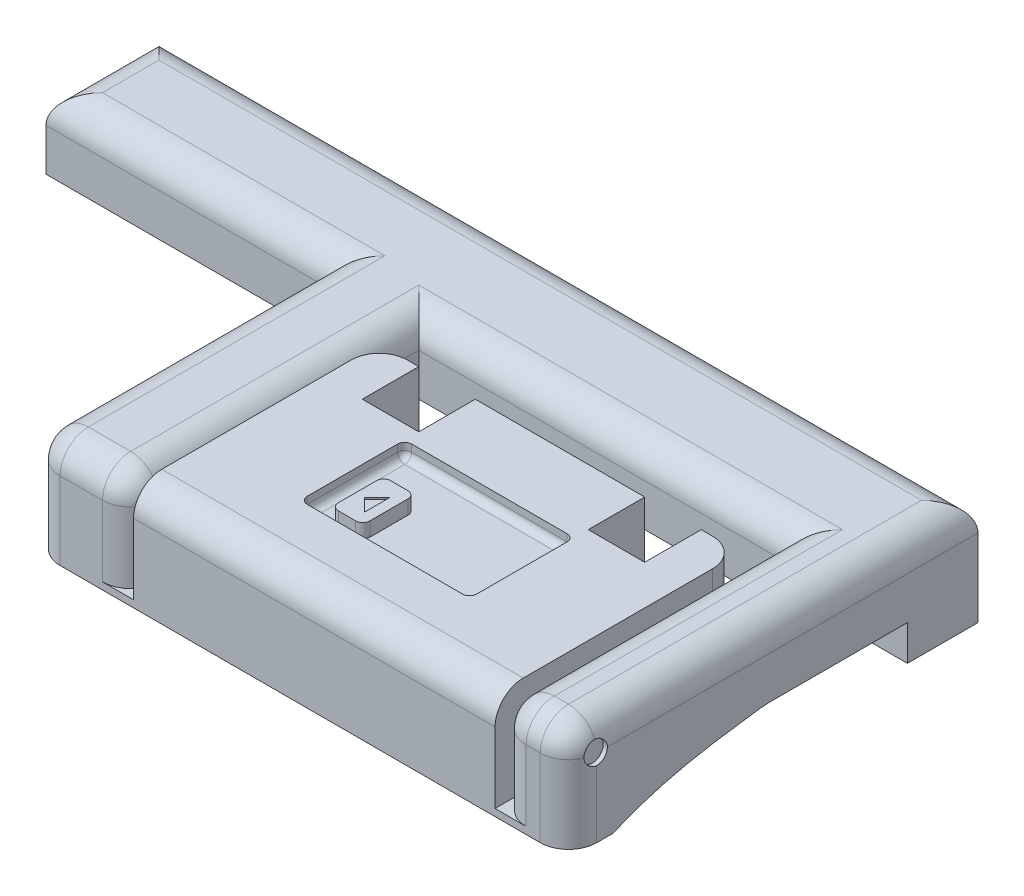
ISO-10303-21;
HEADER;
FILE_DESCRIPTION(('STEP AP214'),'2;1');
FILE_NAME('part.step','',(''),(''),'','','');
FILE_SCHEMA(('AUTOMOTIVE_DESIGN { 1 0 10303 214 1 1 1 1 }'));
ENDSEC;
DATA;
#1=APPLICATION_CONTEXT('core data for automotive mechanical design processes');
#2=APPLICATION_PROTOCOL_DEFINITION('international standard','automotive_design',2000,#1);
#3=PRODUCT_CONTEXT('',#1,'mechanical');
#4=PRODUCT('Part','Part','',(#3));
#5=PRODUCT_RELATED_PRODUCT_CATEGORY('part','',(#4));
#6=PRODUCT_DEFINITION_FORMATION('','',#4);
#7=PRODUCT_DEFINITION_CONTEXT('part definition',#1,'design');
#8=PRODUCT_DEFINITION('design','',#6,#7);
#9=PRODUCT_DEFINITION_SHAPE('','',#8);
#10=(LENGTH_UNIT() NAMED_UNIT(*) SI_UNIT(.MILLI.,.METRE.));
#11=(NAMED_UNIT(*) PLANE_ANGLE_UNIT() SI_UNIT($,.RADIAN.));
#12=(NAMED_UNIT(*) SI_UNIT($,.STERADIAN.) SOLID_ANGLE_UNIT());
#13=UNCERTAINTY_MEASURE_WITH_UNIT(LENGTH_MEASURE(1.E-05),#10,'distance_accuracy_value','');
#14=(GEOMETRIC_REPRESENTATION_CONTEXT(3) GLOBAL_UNCERTAINTY_ASSIGNED_CONTEXT((#13)) GLOBAL_UNIT_ASSIGNED_CONTEXT((#10,
#11,#12)) REPRESENTATION_CONTEXT('',''));
#15=CARTESIAN_POINT('',(0.,0.,0.));
#16=DIRECTION('',(0.,0.,1.));
#17=DIRECTION('',(1.,0.,0.));
#18=AXIS2_PLACEMENT_3D('',#15,#16,#17);
#19=CARTESIAN_POINT('',(46.,6.5,24.));
#20=DIRECTION('',(0.,-1.,0.));
#21=DIRECTION('',(0.,0.,-1.));
#22=AXIS2_PLACEMENT_3D('',#19,#20,#21);
#23=PLANE('',#22);
#24=DIRECTION('',(1.,0.,0.));
#25=VECTOR('',#24,1.);
#26=CARTESIAN_POINT('',(46.,6.5,23.5));
#27=LINE('',#26,#25);
#28=CARTESIAN_POINT('',(34.5,6.5,23.5));
#29=VERTEX_POINT('',#28);
#30=CARTESIAN_POINT('',(45.5,6.5,23.5));
#31=VERTEX_POINT('',#30);
#32=EDGE_CURVE('E1035',#29,#31,#27,.T.);
#33=ORIENTED_EDGE('',*,*,#32,.T.);
#34=DIRECTION('',(0.,0.,-1.));
#35=VECTOR('',#34,1.);
#36=CARTESIAN_POINT('',(45.5,6.5,16.6));
#37=LINE('',#36,#35);
#38=CARTESIAN_POINT('',(45.5,6.5,17.1));
#39=VERTEX_POINT('',#38);
#40=EDGE_CURVE('E1037',#31,#39,#37,.T.);
#41=ORIENTED_EDGE('',*,*,#40,.T.);
#42=DIRECTION('',(-1.,0.,0.));
#43=VECTOR('',#42,1.);
#44=CARTESIAN_POINT('',(34.,6.5,17.1));
#45=LINE('',#44,#43);
#46=CARTESIAN_POINT('',(34.5,6.5,17.1));
#47=VERTEX_POINT('',#46);
#48=EDGE_CURVE('E1033',#39,#47,#45,.T.);
#49=ORIENTED_EDGE('',*,*,#48,.T.);
#50=DIRECTION('',(0.,0.,1.));
#51=VECTOR('',#50,1.);
#52=CARTESIAN_POINT('',(34.5,6.5,24.));
#53=LINE('',#52,#51);
#54=EDGE_CURVE('E1031',#47,#29,#53,.T.);
#55=ORIENTED_EDGE('',*,*,#54,.T.);
#56=EDGE_LOOP('',(#33,#41,#49,#55));
#57=FACE_BOUND('',#56,.T.);
#58=DIRECTION('',(0.,0.,-1.));
#59=VECTOR('',#58,1.);
#60=CARTESIAN_POINT('',(37.7284984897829,6.5,19.5951909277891));
#61=LINE('',#60,#59);
#62=CARTESIAN_POINT('',(37.7284984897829,6.5,22.7936178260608));
#63=VERTEX_POINT('',#62);
#64=CARTESIAN_POINT('',(37.7284984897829,6.5,20.0951909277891));
#65=VERTEX_POINT('',#64);
#66=EDGE_CURVE('E1206',#63,#65,#61,.T.);
#67=ORIENTED_EDGE('',*,*,#66,.F.);
#68=CARTESIAN_POINT('',(37.2284984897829,6.5,22.7936178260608));
#69=DIRECTION('',(0.,-1.,0.));
#70=DIRECTION('',(0.,0.,-1.));
#71=AXIS2_PLACEMENT_3D('',#68,#69,#70);
#72=CIRCLE('',#71,0.5);
#73=CARTESIAN_POINT('',(37.2284984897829,6.5,23.2936178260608));
#74=VERTEX_POINT('',#73);
#75=EDGE_CURVE('E1010',#63,#74,#72,.T.);
#76=ORIENTED_EDGE('',*,*,#75,.T.);
#77=DIRECTION('',(1.,0.,0.));
#78=VECTOR('',#77,1.);
#79=CARTESIAN_POINT('',(37.7284984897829,6.5,23.2936178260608));
#80=LINE('',#79,#78);
#81=CARTESIAN_POINT('',(36.,6.5,23.2936178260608));
#82=VERTEX_POINT('',#81);
#83=EDGE_CURVE('E1219',#82,#74,#80,.T.);
#84=ORIENTED_EDGE('',*,*,#83,.F.);
#85=CARTESIAN_POINT('',(36.,6.5,22.7936178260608));
#86=DIRECTION('',(0.,-1.,0.));
#87=DIRECTION('',(0.,0.,-1.));
#88=AXIS2_PLACEMENT_3D('',#85,#86,#87);
#89=CIRCLE('',#88,0.5);
#90=CARTESIAN_POINT('',(35.5,6.5,22.7936178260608));
#91=VERTEX_POINT('',#90);
#92=EDGE_CURVE('E1012',#82,#91,#89,.T.);
#93=ORIENTED_EDGE('',*,*,#92,.T.);
#94=DIRECTION('',(0.,0.,1.));
#95=VECTOR('',#94,1.);
#96=CARTESIAN_POINT('',(35.5,6.5,19.5951909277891));
#97=LINE('',#96,#95);
#98=CARTESIAN_POINT('',(35.5,6.5,20.0951909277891));
#99=VERTEX_POINT('',#98);
#100=EDGE_CURVE('E1216',#99,#91,#97,.T.);
#101=ORIENTED_EDGE('',*,*,#100,.F.);
#102=CARTESIAN_POINT('',(36.,6.5,20.0951909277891));
#103=DIRECTION('',(0.,-1.,0.));
#104=DIRECTION('',(0.,0.,-1.));
#105=AXIS2_PLACEMENT_3D('',#102,#103,#104);
#106=CIRCLE('',#105,0.5);
#107=CARTESIAN_POINT('',(36.,6.5,19.5951909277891));
#108=VERTEX_POINT('',#107);
#109=EDGE_CURVE('E1014',#99,#108,#106,.T.);
#110=ORIENTED_EDGE('',*,*,#109,.T.);
#111=DIRECTION('',(-1.,0.,0.));
#112=VECTOR('',#111,1.);
#113=CARTESIAN_POINT('',(37.7284984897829,6.5,19.5951909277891));
#114=LINE('',#113,#112);
#115=CARTESIAN_POINT('',(37.2284984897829,6.5,19.5951909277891));
#116=VERTEX_POINT('',#115);
#117=EDGE_CURVE('E1213',#116,#108,#114,.T.);
#118=ORIENTED_EDGE('',*,*,#117,.F.);
#119=CARTESIAN_POINT('',(37.2284984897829,6.5,20.0951909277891));
#120=DIRECTION('',(0.,-1.,0.));
#121=DIRECTION('',(0.,0.,-1.));
#122=AXIS2_PLACEMENT_3D('',#119,#120,#121);
#123=CIRCLE('',#122,0.5);
#124=EDGE_CURVE('E1016',#116,#65,#123,.T.);
#125=ORIENTED_EDGE('',*,*,#124,.T.);
#126=EDGE_LOOP('',(#67,#76,#84,#93,#101,#110,#118,#125));
#127=FACE_BOUND('',#126,.T.);
#128=ADVANCED_FACE('F31',(#57,#127),#23,.F.);
#129=CARTESIAN_POINT('',(-4.99999999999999,2.50000000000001,14.7707280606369));
#130=DIRECTION('',(0.,1.,0.));
#131=DIRECTION('',(0.,0.,1.));
#132=AXIS2_PLACEMENT_3D('',#129,#130,#131);
#133=PLANE('',#132);
#134=DIRECTION('',(0.,0.,1.));
#135=VECTOR('',#134,1.);
#136=CARTESIAN_POINT('',(27.,2.50000000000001,14.7707280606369));
#137=LINE('',#136,#135);
#138=CARTESIAN_POINT('',(27.,2.50000000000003,8.60000000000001));
#139=VERTEX_POINT('',#138);
#140=CARTESIAN_POINT('',(27.,2.50000000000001,14.7707280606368));
#141=VERTEX_POINT('',#140);
#142=EDGE_CURVE('E963',#139,#141,#137,.T.);
#143=ORIENTED_EDGE('',*,*,#142,.T.);
#144=DIRECTION('',(1.,0.,0.));
#145=VECTOR('',#144,1.);
#146=CARTESIAN_POINT('',(-4.99999999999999,2.50000000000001,14.7707280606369));
#147=LINE('',#146,#145);
#148=CARTESIAN_POINT('',(20.,2.50000000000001,14.7707280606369));
#149=VERTEX_POINT('',#148);
#150=EDGE_CURVE('E866',#149,#141,#147,.T.);
#151=ORIENTED_EDGE('',*,*,#150,.F.);
#152=DIRECTION('',(0.,0.,1.));
#153=VECTOR('',#152,1.);
#154=CARTESIAN_POINT('',(20.,2.49999999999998,29.));
#155=LINE('',#154,#153);
#156=CARTESIAN_POINT('',(20.,2.50000000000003,8.));
#157=VERTEX_POINT('',#156);
#158=EDGE_CURVE('E882',#157,#149,#155,.T.);
#159=ORIENTED_EDGE('',*,*,#158,.F.);
#160=DIRECTION('',(1.,0.,0.));
#161=VECTOR('',#160,1.);
#162=CARTESIAN_POINT('',(20.,2.50000000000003,8.));
#163=LINE('',#162,#161);
#164=CARTESIAN_POINT('',(0.,2.50000000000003,8.));
#165=VERTEX_POINT('',#164);
#166=EDGE_CURVE('E888',#165,#157,#163,.T.);
#167=ORIENTED_EDGE('',*,*,#166,.F.);
#168=DIRECTION('',(0.,0.,1.));
#169=VECTOR('',#168,1.);
#170=CARTESIAN_POINT('',(0.,2.50000000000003,7.99999999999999));
#171=LINE('',#170,#169);
#172=CARTESIAN_POINT('',(0.,2.50000000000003,5.00000000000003));
#173=VERTEX_POINT('',#172);
#174=EDGE_CURVE('E891',#173,#165,#171,.T.);
#175=ORIENTED_EDGE('',*,*,#174,.F.);
#176=DIRECTION('',(1.,0.,0.));
#177=VECTOR('',#176,1.);
#178=CARTESIAN_POINT('',(-5.,2.50000000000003,5.00000000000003));
#179=LINE('',#178,#177);
#180=CARTESIAN_POINT('',(58.,2.50000000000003,5.));
#181=VERTEX_POINT('',#180);
#182=EDGE_CURVE('E872',#173,#181,#179,.T.);
#183=ORIENTED_EDGE('',*,*,#182,.T.);
#184=DIRECTION('',(0.,0.,1.));
#185=VECTOR('',#184,1.);
#186=CARTESIAN_POINT('',(58.,2.50000000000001,14.7707280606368));
#187=LINE('',#186,#185);
#188=CARTESIAN_POINT('',(58.,2.50000000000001,14.7707280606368));
#189=VERTEX_POINT('',#188);
#190=EDGE_CURVE('E1397',#181,#189,#187,.T.);
#191=ORIENTED_EDGE('',*,*,#190,.T.);
#192=CARTESIAN_POINT('',(53.,2.50000000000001,14.7707280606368));
#193=VERTEX_POINT('',#192);
#194=EDGE_CURVE('E874',#193,#189,#147,.T.);
#195=ORIENTED_EDGE('',*,*,#194,.F.);
#196=DIRECTION('',(0.,0.,-1.));
#197=VECTOR('',#196,1.);
#198=CARTESIAN_POINT('',(53.,2.50000000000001,14.7707280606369));
#199=LINE('',#198,#197);
#200=CARTESIAN_POINT('',(53.,2.50000000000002,8.60000000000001));
#201=VERTEX_POINT('',#200);
#202=EDGE_CURVE('E968',#193,#201,#199,.T.);
#203=ORIENTED_EDGE('',*,*,#202,.T.);
#204=DIRECTION('',(-1.,0.,0.));
#205=VECTOR('',#204,1.);
#206=CARTESIAN_POINT('',(-4.99999999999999,2.50000000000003,8.60000000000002));
#207=LINE('',#206,#205);
#208=EDGE_CURVE('E965',#201,#139,#207,.T.);
#209=ORIENTED_EDGE('',*,*,#208,.T.);
#210=EDGE_LOOP('',(#143,#151,#159,#167,#175,#183,#191,#195,#203,#209));
#211=FACE_BOUND('',#210,.T.);
#212=ADVANCED_FACE('F758',(#211),#133,.F.);
#213=CARTESIAN_POINT('',(0.,7.5,0.));
#214=DIRECTION('',(0.,-1.,0.));
#215=DIRECTION('',(0.,0.,-1.));
#216=AXIS2_PLACEMENT_3D('',#213,#214,#215);
#217=PLANE('',#216);
#218=DIRECTION('',(1.,0.,0.));
#219=VECTOR('',#218,1.);
#220=CARTESIAN_POINT('',(0.,7.5,6.));
#221=LINE('',#220,#219);
#222=CARTESIAN_POINT('',(2.,7.5,6.));
#223=VERTEX_POINT('',#222);
#224=CARTESIAN_POINT('',(22.,7.5,6.));
#225=VERTEX_POINT('',#224);
#226=EDGE_CURVE('E547',#223,#225,#221,.T.);
#227=ORIENTED_EDGE('',*,*,#226,.T.);
#228=DIRECTION('',(0.,0.,1.));
#229=VECTOR('',#228,1.);
#230=CARTESIAN_POINT('',(22.,7.5,0.));
#231=LINE('',#230,#229);
#232=CARTESIAN_POINT('',(22.,7.5,27.));
#233=VERTEX_POINT('',#232);
#234=EDGE_CURVE('E549',#225,#233,#231,.T.);
#235=ORIENTED_EDGE('',*,*,#234,.T.);
#236=DIRECTION('',(1.,0.,0.));
#237=VECTOR('',#236,1.);
#238=CARTESIAN_POINT('',(0.,7.5,27.));
#239=LINE('',#238,#237);
#240=CARTESIAN_POINT('',(25.,7.5,27.));
#241=VERTEX_POINT('',#240);
#242=EDGE_CURVE('E1060',#233,#241,#239,.T.);
#243=ORIENTED_EDGE('',*,*,#242,.T.);
#244=DIRECTION('',(0.,0.,1.));
#245=VECTOR('',#244,1.);
#246=CARTESIAN_POINT('',(25.,7.5,0.));
#247=LINE('',#246,#245);
#248=CARTESIAN_POINT('',(25.,7.5,6.60000000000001));
#249=VERTEX_POINT('',#248);
#250=EDGE_CURVE('E539',#241,#249,#247,.F.);
#251=ORIENTED_EDGE('',*,*,#250,.T.);
#252=DIRECTION('',(-1.,0.,0.));
#253=VECTOR('',#252,1.);
#254=CARTESIAN_POINT('',(0.,7.5,6.60000000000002));
#255=LINE('',#254,#253);
#256=CARTESIAN_POINT('',(55.,7.5,6.60000000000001));
#257=VERTEX_POINT('',#256);
#258=EDGE_CURVE('E537',#249,#257,#255,.F.);
#259=ORIENTED_EDGE('',*,*,#258,.T.);
#260=DIRECTION('',(0.,0.,-1.));
#261=VECTOR('',#260,1.);
#262=CARTESIAN_POINT('',(55.,7.5,0.));
#263=LINE('',#262,#261);
#264=CARTESIAN_POINT('',(55.,7.5,27.));
#265=VERTEX_POINT('',#264);
#266=EDGE_CURVE('E535',#257,#265,#263,.F.);
#267=ORIENTED_EDGE('',*,*,#266,.T.);
#268=DIRECTION('',(1.,0.,0.));
#269=VECTOR('',#268,1.);
#270=CARTESIAN_POINT('',(0.,7.5,27.));
#271=LINE('',#270,#269);
#272=CARTESIAN_POINT('',(56.,7.5,27.));
#273=VERTEX_POINT('',#272);
#274=EDGE_CURVE('E1063',#265,#273,#271,.T.);
#275=ORIENTED_EDGE('',*,*,#274,.T.);
#276=DIRECTION('',(0.,0.,-1.));
#277=VECTOR('',#276,1.);
#278=CARTESIAN_POINT('',(56.,7.5,0.));
#279=LINE('',#278,#277);
#280=CARTESIAN_POINT('',(56.,7.5,2.));
#281=VERTEX_POINT('',#280);
#282=EDGE_CURVE('E541',#273,#281,#279,.T.);
#283=ORIENTED_EDGE('',*,*,#282,.T.);
#284=DIRECTION('',(-1.,0.,0.));
#285=VECTOR('',#284,1.);
#286=CARTESIAN_POINT('',(0.,7.5,2.));
#287=LINE('',#286,#285);
#288=CARTESIAN_POINT('',(2.,7.5,2.));
#289=VERTEX_POINT('',#288);
#290=EDGE_CURVE('E543',#281,#289,#287,.T.);
#291=ORIENTED_EDGE('',*,*,#290,.T.);
#292=DIRECTION('',(0.,0.,1.));
#293=VECTOR('',#292,1.);
#294=CARTESIAN_POINT('',(2.,7.5,0.));
#295=LINE('',#294,#293);
#296=EDGE_CURVE('E545',#289,#223,#295,.T.);
#297=ORIENTED_EDGE('',*,*,#296,.T.);
#298=EDGE_LOOP('',(#227,#235,#243,#251,#259,#267,#275,#283,#291,#297));
#299=FACE_BOUND('',#298,.T.);
#300=ADVANCED_FACE('F1127',(#299),#217,.F.);
#301=CARTESIAN_POINT('',(-4.99999999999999,2.45670539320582,15.4272885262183));
#302=DIRECTION('',(0.,0.997832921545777,0.0657986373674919));
#303=DIRECTION('',(0.,-0.0657986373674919,0.997832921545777));
#304=AXIS2_PLACEMENT_3D('',#301,#302,#303);
#305=PLANE('',#304);
#306=ORIENTED_EDGE('',*,*,#150,.T.);
#307=DIRECTION('',(0.,-0.0657986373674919,0.997832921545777));
#308=VECTOR('',#307,1.);
#309=CARTESIAN_POINT('',(27.,2.45670539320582,15.4272885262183));
#310=LINE('',#309,#308);
#311=CARTESIAN_POINT('',(27.,2.45670539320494,15.4272885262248));
#312=VERTEX_POINT('',#311);
#313=EDGE_CURVE('E1280',#141,#312,#310,.T.);
#314=ORIENTED_EDGE('',*,*,#313,.T.);
#315=DIRECTION('',(1.,0.,0.));
#316=VECTOR('',#315,1.);
#317=CARTESIAN_POINT('',(-4.99999999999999,2.45670539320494,15.4272885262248));
#318=LINE('',#317,#316);
#319=CARTESIAN_POINT('',(20.,2.45670539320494,15.4272885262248));
#320=VERTEX_POINT('',#319);
#321=EDGE_CURVE('E857',#320,#312,#318,.T.);
#322=ORIENTED_EDGE('',*,*,#321,.F.);
#323=DIRECTION('',(0.,-0.0657986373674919,0.997832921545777));
#324=VECTOR('',#323,1.);
#325=CARTESIAN_POINT('',(20.,1.58740956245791,28.6101146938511));
#326=LINE('',#325,#324);
#327=EDGE_CURVE('E894',#149,#320,#326,.T.);
#328=ORIENTED_EDGE('',*,*,#327,.F.);
#329=EDGE_LOOP('',(#306,#314,#322,#328));
#330=FACE_BOUND('',#329,.T.);
#331=ADVANCED_FACE('F1773',(#330),#305,.F.);
#332=CARTESIAN_POINT('',(53.,2.45670539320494,15.4272885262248));
#333=VERTEX_POINT('',#332);
#334=CARTESIAN_POINT('',(58.,2.45670539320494,15.4272885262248));
#335=VERTEX_POINT('',#334);
#336=EDGE_CURVE('E869',#333,#335,#318,.T.);
#337=ORIENTED_EDGE('',*,*,#336,.F.);
#338=DIRECTION('',(0.,0.0657986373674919,-0.997832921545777));
#339=VECTOR('',#338,1.);
#340=CARTESIAN_POINT('',(53.,2.45670539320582,15.4272885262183));
#341=LINE('',#340,#339);
#342=EDGE_CURVE('E1315',#333,#193,#341,.T.);
#343=ORIENTED_EDGE('',*,*,#342,.T.);
#344=ORIENTED_EDGE('',*,*,#194,.T.);
#345=DIRECTION('',(0.,-0.0657986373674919,0.997832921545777));
#346=VECTOR('',#345,1.);
#347=CARTESIAN_POINT('',(58.,2.45670539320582,15.4272885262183));
#348=LINE('',#347,#346);
#349=EDGE_CURVE('E1399',#189,#335,#348,.T.);
#350=ORIENTED_EDGE('',*,*,#349,.T.);
#351=EDGE_LOOP('',(#337,#343,#344,#350));
#352=FACE_BOUND('',#351,.T.);
#353=ADVANCED_FACE('F1848',(#352),#305,.F.);
#354=DIRECTION('',(0.,0.,-1.));
#355=VECTOR('',#354,1.);
#356=CARTESIAN_POINT('',(27.2,2.50000000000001,14.7707280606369));
#357=LINE('',#356,#355);
#358=CARTESIAN_POINT('',(27.2,2.50000000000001,14.7707280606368));
#359=VERTEX_POINT('',#358);
#360=CARTESIAN_POINT('',(27.2,2.50000000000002,13.6));
#361=VERTEX_POINT('',#360);
#362=EDGE_CURVE('E1272',#359,#361,#357,.T.);
#363=ORIENTED_EDGE('',*,*,#362,.T.);
#364=CARTESIAN_POINT('',(29.2,2.50000000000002,13.6));
#365=DIRECTION('',(0.,1.,0.));
#366=DIRECTION('',(0.,0.,1.));
#367=AXIS2_PLACEMENT_3D('',#364,#365,#366);
#368=CIRCLE('',#367,2.);
#369=CARTESIAN_POINT('',(29.2,2.50000000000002,11.6));
#370=VERTEX_POINT('',#369);
#371=EDGE_CURVE('E578',#361,#370,#368,.F.);
#372=ORIENTED_EDGE('',*,*,#371,.T.);
#373=DIRECTION('',(1.,0.,0.));
#374=VECTOR('',#373,1.);
#375=CARTESIAN_POINT('',(-4.99999999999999,2.50000000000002,11.6));
#376=LINE('',#375,#374);
#377=CARTESIAN_POINT('',(30.,2.50000000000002,11.6));
#378=VERTEX_POINT('',#377);
#379=EDGE_CURVE('E958',#370,#378,#376,.T.);
#380=ORIENTED_EDGE('',*,*,#379,.T.);
#381=DIRECTION('',(0.,0.,1.));
#382=VECTOR('',#381,1.);
#383=CARTESIAN_POINT('',(30.,2.50000000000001,14.7707280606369));
#384=LINE('',#383,#382);
#385=CARTESIAN_POINT('',(30.,2.50000000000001,14.7707280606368));
#386=VERTEX_POINT('',#385);
#387=EDGE_CURVE('E1373',#378,#386,#384,.T.);
#388=ORIENTED_EDGE('',*,*,#387,.T.);
#389=EDGE_CURVE('E870',#359,#386,#147,.T.);
#390=ORIENTED_EDGE('',*,*,#389,.F.);
#391=EDGE_LOOP('',(#363,#372,#380,#388,#390));
#392=FACE_BOUND('',#391,.T.);
#393=ADVANCED_FACE('F1836',(#392),#133,.F.);
#394=CARTESIAN_POINT('',(50.,2.50000000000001,14.7707280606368));
#395=VERTEX_POINT('',#394);
#396=CARTESIAN_POINT('',(52.8,2.50000000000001,14.7707280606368));
#397=VERTEX_POINT('',#396);
#398=EDGE_CURVE('E2131',#395,#397,#147,.T.);
#399=ORIENTED_EDGE('',*,*,#398,.T.);
#400=DIRECTION('',(0.,-0.0657986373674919,0.997832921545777));
#401=VECTOR('',#400,1.);
#402=CARTESIAN_POINT('',(52.8,2.45670539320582,15.4272885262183));
#403=LINE('',#402,#401);
#404=CARTESIAN_POINT('',(52.8,2.45670539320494,15.4272885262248));
#405=VERTEX_POINT('',#404);
#406=EDGE_CURVE('E1302',#397,#405,#403,.T.);
#407=ORIENTED_EDGE('',*,*,#406,.T.);
#408=CARTESIAN_POINT('',(50.,2.45670539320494,15.4272885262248));
#409=VERTEX_POINT('',#408);
#410=EDGE_CURVE('E2125',#409,#405,#318,.T.);
#411=ORIENTED_EDGE('',*,*,#410,.F.);
#412=DIRECTION('',(0.,0.0657986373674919,-0.997832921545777));
#413=VECTOR('',#412,1.);
#414=CARTESIAN_POINT('',(50.,2.45670539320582,15.4272885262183));
#415=LINE('',#414,#413);
#416=EDGE_CURVE('E1388',#409,#395,#415,.T.);
#417=ORIENTED_EDGE('',*,*,#416,.T.);
#418=EDGE_LOOP('',(#399,#407,#411,#417));
#419=FACE_BOUND('',#418,.T.);
#420=ADVANCED_FACE('F1841',(#419),#305,.F.);
#421=CARTESIAN_POINT('',(34.,2.50000000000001,14.7707280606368));
#422=VERTEX_POINT('',#421);
#423=CARTESIAN_POINT('',(46.,2.50000000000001,14.7707280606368));
#424=VERTEX_POINT('',#423);
#425=EDGE_CURVE('E871',#422,#424,#147,.T.);
#426=ORIENTED_EDGE('',*,*,#425,.T.);
#427=DIRECTION('',(0.,-0.0657986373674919,0.997832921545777));
#428=VECTOR('',#427,1.);
#429=CARTESIAN_POINT('',(46.,2.45670539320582,15.4272885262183));
#430=LINE('',#429,#428);
#431=CARTESIAN_POINT('',(46.,2.45670539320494,15.4272885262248));
#432=VERTEX_POINT('',#431);
#433=EDGE_CURVE('E1382',#424,#432,#430,.T.);
#434=ORIENTED_EDGE('',*,*,#433,.T.);
#435=CARTESIAN_POINT('',(34.,2.45670539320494,15.4272885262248));
#436=VERTEX_POINT('',#435);
#437=EDGE_CURVE('E865',#436,#432,#318,.T.);
#438=ORIENTED_EDGE('',*,*,#437,.F.);
#439=DIRECTION('',(0.,0.0657986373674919,-0.997832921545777));
#440=VECTOR('',#439,1.);
#441=CARTESIAN_POINT('',(34.,2.45670539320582,15.4272885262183));
#442=LINE('',#441,#440);
#443=EDGE_CURVE('E1376',#436,#422,#442,.T.);
#444=ORIENTED_EDGE('',*,*,#443,.T.);
#445=EDGE_LOOP('',(#426,#434,#438,#444));
#446=FACE_BOUND('',#445,.T.);
#447=ADVANCED_FACE('F1774',(#446),#305,.F.);
#448=DIRECTION('',(1.,0.,0.));
#449=VECTOR('',#448,1.);
#450=CARTESIAN_POINT('',(-4.99999999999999,2.50000000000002,11.6));
#451=LINE('',#450,#449);
#452=CARTESIAN_POINT('',(34.,2.50000000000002,11.6));
#453=VERTEX_POINT('',#452);
#454=CARTESIAN_POINT('',(46.,2.50000000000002,11.6));
#455=VERTEX_POINT('',#454);
#456=EDGE_CURVE('E974',#453,#455,#451,.T.);
#457=ORIENTED_EDGE('',*,*,#456,.T.);
#458=DIRECTION('',(0.,0.,1.));
#459=VECTOR('',#458,1.);
#460=CARTESIAN_POINT('',(46.,2.50000000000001,14.7707280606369));
#461=LINE('',#460,#459);
#462=EDGE_CURVE('E1385',#455,#424,#461,.T.);
#463=ORIENTED_EDGE('',*,*,#462,.T.);
#464=ORIENTED_EDGE('',*,*,#425,.F.);
#465=DIRECTION('',(0.,0.,-1.));
#466=VECTOR('',#465,1.);
#467=CARTESIAN_POINT('',(34.,2.50000000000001,14.7707280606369));
#468=LINE('',#467,#466);
#469=EDGE_CURVE('E1379',#422,#453,#468,.T.);
#470=ORIENTED_EDGE('',*,*,#469,.T.);
#471=EDGE_LOOP('',(#457,#463,#464,#470));
#472=FACE_BOUND('',#471,.T.);
#473=ADVANCED_FACE('F1765',(#472),#133,.F.);
#474=CARTESIAN_POINT('',(0.,0.,0.));
#475=DIRECTION('',(0.,-1.,0.));
#476=DIRECTION('',(0.,0.,-1.));
#477=AXIS2_PLACEMENT_3D('',#474,#475,#476);
#478=PLANE('',#477);
#479=DIRECTION('',(1.,0.,0.));
#480=VECTOR('',#479,1.);
#481=CARTESIAN_POINT('',(58.,0.,29.));
#482=LINE('',#481,#480);
#483=CARTESIAN_POINT('',(22.,0.,29.));
#484=VERTEX_POINT('',#483);
#485=CARTESIAN_POINT('',(56.,0.,29.));
#486=VERTEX_POINT('',#485);
#487=EDGE_CURVE('E902',#484,#486,#482,.T.);
#488=ORIENTED_EDGE('',*,*,#487,.F.);
#489=CARTESIAN_POINT('',(22.,0.,27.));
#490=DIRECTION('',(0.,-1.,0.));
#491=DIRECTION('',(0.,0.,-1.));
#492=AXIS2_PLACEMENT_3D('',#489,#490,#491);
#493=CIRCLE('',#492,2.);
#494=CARTESIAN_POINT('',(20.,0.,27.));
#495=VERTEX_POINT('',#494);
#496=EDGE_CURVE('E513',#484,#495,#493,.T.);
#497=ORIENTED_EDGE('',*,*,#496,.T.);
#498=DIRECTION('',(0.,0.,1.));
#499=VECTOR('',#498,1.);
#500=CARTESIAN_POINT('',(20.,0.,29.));
#501=LINE('',#500,#499);
#502=CARTESIAN_POINT('',(20.,0.,25.857566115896));
#503=VERTEX_POINT('',#502);
#504=EDGE_CURVE('E900',#503,#495,#501,.T.);
#505=ORIENTED_EDGE('',*,*,#504,.F.);
#506=DIRECTION('',(1.,0.,0.));
#507=VECTOR('',#506,1.);
#508=CARTESIAN_POINT('',(-4.99999999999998,0.,25.85756611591));
#509=LINE('',#508,#507);
#510=CARTESIAN_POINT('',(58.,0.,25.857566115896));
#511=VERTEX_POINT('',#510);
#512=EDGE_CURVE('E921',#511,#503,#509,.F.);
#513=ORIENTED_EDGE('',*,*,#512,.F.);
#514=DIRECTION('',(0.,0.,-1.));
#515=VECTOR('',#514,1.);
#516=CARTESIAN_POINT('',(58.,0.,0.));
#517=LINE('',#516,#515);
#518=CARTESIAN_POINT('',(58.,0.,27.));
#519=VERTEX_POINT('',#518);
#520=EDGE_CURVE('E906',#519,#511,#517,.T.);
#521=ORIENTED_EDGE('',*,*,#520,.F.);
#522=CARTESIAN_POINT('',(56.,0.,27.));
#523=DIRECTION('',(0.,-1.,0.));
#524=DIRECTION('',(0.,0.,-1.));
#525=AXIS2_PLACEMENT_3D('',#522,#523,#524);
#526=CIRCLE('',#525,2.);
#527=EDGE_CURVE('E517',#519,#486,#526,.T.);
#528=ORIENTED_EDGE('',*,*,#527,.T.);
#529=EDGE_LOOP('',(#488,#497,#505,#513,#521,#528));
#530=FACE_BOUND('',#529,.T.);
#531=ADVANCED_FACE('F1103',(#530),#478,.T.);
#532=CARTESIAN_POINT('',(0.,7.5,8.));
#533=DIRECTION('',(1.,0.,0.));
#534=DIRECTION('',(0.,0.,-1.));
#535=AXIS2_PLACEMENT_3D('',#532,#533,#534);
#536=PLANE('',#535);
#537=DIRECTION('',(0.,-1.,0.));
#538=VECTOR('',#537,1.);
#539=CARTESIAN_POINT('',(0.,7.5,8.));
#540=LINE('',#539,#538);
#541=CARTESIAN_POINT('',(0.,5.5,8.));
#542=VERTEX_POINT('',#541);
#543=EDGE_CURVE('E917',#542,#165,#540,.T.);
#544=ORIENTED_EDGE('',*,*,#543,.F.);
#545=DIRECTION('',(0.,0.,1.));
#546=VECTOR('',#545,1.);
#547=CARTESIAN_POINT('',(0.,5.5,8.));
#548=LINE('',#547,#546);
#549=CARTESIAN_POINT('',(0.,5.5,0.));
#550=VERTEX_POINT('',#549);
#551=EDGE_CURVE('E553',#542,#550,#548,.F.);
#552=ORIENTED_EDGE('',*,*,#551,.T.);
#553=DIRECTION('',(0.,-1.,0.));
#554=VECTOR('',#553,1.);
#555=CARTESIAN_POINT('',(0.,7.5,0.));
#556=LINE('',#555,#554);
#557=CARTESIAN_POINT('',(0.,0.,0.));
#558=VERTEX_POINT('',#557);
#559=EDGE_CURVE('E911',#550,#558,#556,.T.);
#560=ORIENTED_EDGE('',*,*,#559,.T.);
#561=DIRECTION('',(0.,0.,1.));
#562=VECTOR('',#561,1.);
#563=CARTESIAN_POINT('',(0.,0.,8.));
#564=LINE('',#563,#562);
#565=CARTESIAN_POINT('',(0.,0.,5.00000000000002));
#566=VERTEX_POINT('',#565);
#567=EDGE_CURVE('E897',#558,#566,#564,.T.);
#568=ORIENTED_EDGE('',*,*,#567,.T.);
#569=DIRECTION('',(0.,1.,0.));
#570=VECTOR('',#569,1.);
#571=CARTESIAN_POINT('',(0.,7.5,5.00000000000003));
#572=LINE('',#571,#570);
#573=EDGE_CURVE('E863',#566,#173,#572,.T.);
#574=ORIENTED_EDGE('',*,*,#573,.T.);
#575=ORIENTED_EDGE('',*,*,#174,.T.);
#576=EDGE_LOOP('',(#544,#552,#560,#568,#574,#575));
#577=FACE_BOUND('',#576,.T.);
#578=ADVANCED_FACE('F33',(#577),#536,.F.);
#579=CARTESIAN_POINT('',(20.,7.5,8.));
#580=DIRECTION('',(0.,0.,-1.));
#581=DIRECTION('',(-1.,0.,0.));
#582=AXIS2_PLACEMENT_3D('',#579,#580,#581);
#583=PLANE('',#582);
#584=DIRECTION('',(0.,-1.,0.));
#585=VECTOR('',#584,1.);
#586=CARTESIAN_POINT('',(20.,7.5,8.));
#587=LINE('',#586,#585);
#588=CARTESIAN_POINT('',(20.,5.5,8.));
#589=VERTEX_POINT('',#588);
#590=EDGE_CURVE('E915',#589,#157,#587,.T.);
#591=ORIENTED_EDGE('',*,*,#590,.F.);
#592=DIRECTION('',(1.,0.,0.));
#593=VECTOR('',#592,1.);
#594=CARTESIAN_POINT('',(20.,5.5,8.));
#595=LINE('',#594,#593);
#596=EDGE_CURVE('E551',#589,#542,#595,.F.);
#597=ORIENTED_EDGE('',*,*,#596,.T.);
#598=ORIENTED_EDGE('',*,*,#543,.T.);
#599=ORIENTED_EDGE('',*,*,#166,.T.);
#600=EDGE_LOOP('',(#591,#597,#598,#599));
#601=FACE_BOUND('',#600,.T.);
#602=ADVANCED_FACE('F1813',(#601),#583,.F.);
#603=CARTESIAN_POINT('',(20.,7.5,29.));
#604=DIRECTION('',(1.,0.,0.));
#605=DIRECTION('',(0.,0.,-1.));
#606=AXIS2_PLACEMENT_3D('',#603,#604,#605);
#607=PLANE('',#606);
#608=DIRECTION('',(0.,-1.,0.));
#609=VECTOR('',#608,1.);
#610=CARTESIAN_POINT('',(20.,7.5,27.));
#611=LINE('',#610,#609);
#612=CARTESIAN_POINT('',(20.,4.74126701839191,27.));
#613=VERTEX_POINT('',#612);
#614=EDGE_CURVE('E505',#495,#613,#611,.F.);
#615=ORIENTED_EDGE('',*,*,#614,.T.);
#616=CARTESIAN_POINT('',(20.,5.5,27.));
#617=DIRECTION('',(-1.,0.,0.));
#618=DIRECTION('',(0.,0.,1.));
#619=AXIS2_PLACEMENT_3D('',#616,#617,#618);
#620=CIRCLE('',#619,0.758732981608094);
#621=CARTESIAN_POINT('',(20.,5.5,26.2412670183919));
#622=VERTEX_POINT('',#621);
#623=EDGE_CURVE('E50',#622,#613,#620,.T.);
#624=ORIENTED_EDGE('',*,*,#623,.F.);
#625=DIRECTION('',(0.,0.,1.));
#626=VECTOR('',#625,1.);
#627=CARTESIAN_POINT('',(20.,5.5,29.));
#628=LINE('',#627,#626);
#629=EDGE_CURVE('E501',#622,#589,#628,.F.);
#630=ORIENTED_EDGE('',*,*,#629,.T.);
#631=ORIENTED_EDGE('',*,*,#590,.T.);
#632=ORIENTED_EDGE('',*,*,#158,.T.);
#633=ORIENTED_EDGE('',*,*,#327,.T.);
#634=CARTESIAN_POINT('',(20.,2.45670539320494,15.4272885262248));
#635=CARTESIAN_POINT('',(20.,2.11217599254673,18.0283143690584));
#636=CARTESIAN_POINT('',(20.,1.49424303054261,22.4809744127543));
#637=CARTESIAN_POINT('',(20.,-0.275568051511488,26.5787308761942));
#638=CARTESIAN_POINT('',(20.,-1.08561553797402,28.2650204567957));
#639=B_SPLINE_CURVE_WITH_KNOTS('',3,(#634,#635,#636,#637,#638),.UNSPECIFIED.,.F.,.F.,(4,1,4),
(0.01941946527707,0.48243448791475,0.813531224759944),.UNSPECIFIED.);
#640=EDGE_CURVE('E877',#320,#503,#639,.T.);
#641=ORIENTED_EDGE('',*,*,#640,.T.);
#642=ORIENTED_EDGE('',*,*,#504,.T.);
#643=EDGE_LOOP('',(#615,#624,#630,#631,#632,#633,#641,#642));
#644=FACE_BOUND('',#643,.T.);
#645=ADVANCED_FACE('F500',(#644),#607,.F.);
#646=CARTESIAN_POINT('',(58.,7.5,29.));
#647=DIRECTION('',(0.,0.,-1.));
#648=DIRECTION('',(-1.,0.,0.));
#649=AXIS2_PLACEMENT_3D('',#646,#647,#648);
#650=PLANE('',#649);
#651=DIRECTION('',(1.,0.,0.));
#652=VECTOR('',#651,1.);
#653=CARTESIAN_POINT('',(27.,0.500000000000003,29.));
#654=LINE('',#653,#652);
#655=CARTESIAN_POINT('',(25.,0.500000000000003,29.));
#656=VERTEX_POINT('',#655);
#657=CARTESIAN_POINT('',(27.2,0.500000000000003,29.));
#658=VERTEX_POINT('',#657);
#659=EDGE_CURVE('E1252',#656,#658,#654,.T.);
#660=ORIENTED_EDGE('',*,*,#659,.F.);
#661=DIRECTION('',(0.,1.,0.));
#662=VECTOR('',#661,1.);
#663=CARTESIAN_POINT('',(25.,7.5,29.));
#664=LINE('',#663,#662);
#665=CARTESIAN_POINT('',(25.,5.5,29.));
#666=VERTEX_POINT('',#665);
#667=EDGE_CURVE('E1089',#656,#666,#664,.T.);
#668=ORIENTED_EDGE('',*,*,#667,.T.);
#669=DIRECTION('',(1.,0.,0.));
#670=VECTOR('',#669,1.);
#671=CARTESIAN_POINT('',(58.,5.5,29.));
#672=LINE('',#671,#670);
#673=CARTESIAN_POINT('',(22.,5.5,29.));
#674=VERTEX_POINT('',#673);
#675=EDGE_CURVE('E1066',#666,#674,#672,.F.);
#676=ORIENTED_EDGE('',*,*,#675,.T.);
#677=DIRECTION('',(0.,-1.,0.));
#678=VECTOR('',#677,1.);
#679=CARTESIAN_POINT('',(22.,7.5,29.));
#680=LINE('',#679,#678);
#681=EDGE_CURVE('E1086',#674,#484,#680,.T.);
#682=ORIENTED_EDGE('',*,*,#681,.T.);
#683=ORIENTED_EDGE('',*,*,#487,.T.);
#684=DIRECTION('',(0.,-1.,0.));
#685=VECTOR('',#684,1.);
#686=CARTESIAN_POINT('',(56.,7.5,29.));
#687=LINE('',#686,#685);
#688=CARTESIAN_POINT('',(56.,5.5,29.));
#689=VERTEX_POINT('',#688);
#690=EDGE_CURVE('E1084',#486,#689,#687,.F.);
#691=ORIENTED_EDGE('',*,*,#690,.T.);
#692=DIRECTION('',(1.,0.,0.));
#693=VECTOR('',#692,1.);
#694=CARTESIAN_POINT('',(58.,5.5,29.));
#695=LINE('',#694,#693);
#696=CARTESIAN_POINT('',(55.,5.5,29.));
#697=VERTEX_POINT('',#696);
#698=EDGE_CURVE('E1071',#689,#697,#695,.F.);
#699=ORIENTED_EDGE('',*,*,#698,.T.);
#700=DIRECTION('',(0.,1.,0.));
#701=VECTOR('',#700,1.);
#702=CARTESIAN_POINT('',(55.,7.5,29.));
#703=LINE('',#702,#701);
#704=CARTESIAN_POINT('',(55.,0.500000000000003,29.));
#705=VERTEX_POINT('',#704);
#706=EDGE_CURVE('E1081',#697,#705,#703,.F.);
#707=ORIENTED_EDGE('',*,*,#706,.T.);
#708=DIRECTION('',(1.,0.,0.));
#709=VECTOR('',#708,1.);
#710=CARTESIAN_POINT('',(53.,0.500000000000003,29.));
#711=LINE('',#710,#709);
#712=CARTESIAN_POINT('',(52.8,0.500000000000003,29.));
#713=VERTEX_POINT('',#712);
#714=EDGE_CURVE('E1292',#713,#705,#711,.T.);
#715=ORIENTED_EDGE('',*,*,#714,.F.);
#716=DIRECTION('',(0.,1.,0.));
#717=VECTOR('',#716,1.);
#718=CARTESIAN_POINT('',(52.8,0.500000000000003,29.));
#719=LINE('',#718,#717);
#720=CARTESIAN_POINT('',(52.8,5.5,29.));
#721=VERTEX_POINT('',#720);
#722=EDGE_CURVE('E1294',#713,#721,#719,.T.);
#723=ORIENTED_EDGE('',*,*,#722,.T.);
#724=DIRECTION('',(1.,0.,0.));
#725=VECTOR('',#724,1.);
#726=CARTESIAN_POINT('',(58.,5.5,29.));
#727=LINE('',#726,#725);
#728=CARTESIAN_POINT('',(27.2,5.5,29.));
#729=VERTEX_POINT('',#728);
#730=EDGE_CURVE('E1069',#721,#729,#727,.F.);
#731=ORIENTED_EDGE('',*,*,#730,.T.);
#732=DIRECTION('',(0.,1.,0.));
#733=VECTOR('',#732,1.);
#734=CARTESIAN_POINT('',(27.2,0.500000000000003,29.));
#735=LINE('',#734,#733);
#736=EDGE_CURVE('E1258',#658,#729,#735,.T.);
#737=ORIENTED_EDGE('',*,*,#736,.F.);
#738=EDGE_LOOP('',(#660,#668,#676,#682,#683,#691,#699,#707,#715,#723,#731,#737));
#739=FACE_BOUND('',#738,.T.);
#740=ADVANCED_FACE('F1108',(#739),#650,.F.);
#741=CARTESIAN_POINT('',(58.,7.5,0.));
#742=DIRECTION('',(-1.,0.,0.));
#743=DIRECTION('',(0.,0.,1.));
#744=AXIS2_PLACEMENT_3D('',#741,#742,#743);
#745=PLANE('',#744);
#746=DIRECTION('',(0.,0.,-1.));
#747=VECTOR('',#746,1.);
#748=CARTESIAN_POINT('',(58.,5.5,0.));
#749=LINE('',#748,#747);
#750=CARTESIAN_POINT('',(58.,5.5,0.));
#751=VERTEX_POINT('',#750);
#752=CARTESIAN_POINT('',(58.,5.5,26.2412670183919));
#753=VERTEX_POINT('',#752);
#754=EDGE_CURVE('E515',#751,#753,#749,.F.);
#755=ORIENTED_EDGE('',*,*,#754,.T.);
#756=CARTESIAN_POINT('',(58.,5.5,27.));
#757=DIRECTION('',(1.,0.,0.));
#758=DIRECTION('',(0.,0.,-1.));
#759=AXIS2_PLACEMENT_3D('',#756,#757,#758);
#760=CIRCLE('',#759,0.758732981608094);
#761=CARTESIAN_POINT('',(58.,4.74126701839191,27.));
#762=VERTEX_POINT('',#761);
#763=EDGE_CURVE('E58',#762,#753,#760,.T.);
#764=ORIENTED_EDGE('',*,*,#763,.F.);
#765=DIRECTION('',(0.,-1.,0.));
#766=VECTOR('',#765,1.);
#767=CARTESIAN_POINT('',(58.,7.5,27.));
#768=LINE('',#767,#766);
#769=EDGE_CURVE('E523',#762,#519,#768,.T.);
#770=ORIENTED_EDGE('',*,*,#769,.T.);
#771=ORIENTED_EDGE('',*,*,#520,.T.);
#772=CARTESIAN_POINT('',(58.,2.45670539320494,15.4272885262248));
#773=CARTESIAN_POINT('',(58.,2.11217599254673,18.0283143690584));
#774=CARTESIAN_POINT('',(58.,1.49424303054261,22.4809744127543));
#775=CARTESIAN_POINT('',(58.,-0.275568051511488,26.5787308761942));
#776=CARTESIAN_POINT('',(58.,-1.08561553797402,28.2650204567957));
#777=B_SPLINE_CURVE_WITH_KNOTS('',3,(#772,#773,#774,#775,#776),.UNSPECIFIED.,.F.,.F.,(4,1,4),
(0.01941946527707,0.48243448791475,0.813531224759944),.UNSPECIFIED.);
#778=EDGE_CURVE('E853',#335,#511,#777,.T.);
#779=ORIENTED_EDGE('',*,*,#778,.F.);
#780=ORIENTED_EDGE('',*,*,#349,.F.);
#781=ORIENTED_EDGE('',*,*,#190,.F.);
#782=DIRECTION('',(0.,1.,0.));
#783=VECTOR('',#782,1.);
#784=CARTESIAN_POINT('',(58.,0.500000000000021,5.));
#785=LINE('',#784,#783);
#786=CARTESIAN_POINT('',(58.,0.,5.));
#787=VERTEX_POINT('',#786);
#788=EDGE_CURVE('E1394',#787,#181,#785,.T.);
#789=ORIENTED_EDGE('',*,*,#788,.F.);
#790=CARTESIAN_POINT('',(58.,0.,0.));
#791=VERTEX_POINT('',#790);
#792=EDGE_CURVE('E905',#787,#791,#517,.T.);
#793=ORIENTED_EDGE('',*,*,#792,.T.);
#794=DIRECTION('',(0.,-1.,0.));
#795=VECTOR('',#794,1.);
#796=CARTESIAN_POINT('',(58.,7.5,0.));
#797=LINE('',#796,#795);
#798=EDGE_CURVE('E913',#751,#791,#797,.T.);
#799=ORIENTED_EDGE('',*,*,#798,.F.);
#800=EDGE_LOOP('',(#755,#764,#770,#771,#779,#780,#781,#789,#793,#799));
#801=FACE_BOUND('',#800,.T.);
#802=ADVANCED_FACE('F1794',(#801),#745,.F.);
#803=CARTESIAN_POINT('',(0.,7.5,0.));
#804=DIRECTION('',(0.,0.,1.));
#805=DIRECTION('',(1.,0.,0.));
#806=AXIS2_PLACEMENT_3D('',#803,#804,#805);
#807=PLANE('',#806);
#808=ORIENTED_EDGE('',*,*,#559,.F.);
#809=DIRECTION('',(-1.,0.,0.));
#810=VECTOR('',#809,1.);
#811=CARTESIAN_POINT('',(0.,5.5,0.));
#812=LINE('',#811,#810);
#813=EDGE_CURVE('E555',#550,#751,#812,.F.);
#814=ORIENTED_EDGE('',*,*,#813,.T.);
#815=ORIENTED_EDGE('',*,*,#798,.T.);
#816=DIRECTION('',(-1.,0.,0.));
#817=VECTOR('',#816,1.);
#818=CARTESIAN_POINT('',(0.,0.,0.));
#819=LINE('',#818,#817);
#820=EDGE_CURVE('E908',#791,#558,#819,.T.);
#821=ORIENTED_EDGE('',*,*,#820,.T.);
#822=EDGE_LOOP('',(#808,#814,#815,#821));
#823=FACE_BOUND('',#822,.T.);
#824=ADVANCED_FACE('F1787',(#823),#807,.F.);
#825=DIRECTION('',(-1.,0.,0.));
#826=VECTOR('',#825,1.);
#827=CARTESIAN_POINT('',(46.,7.5,16.6));
#828=LINE('',#827,#826);
#829=CARTESIAN_POINT('',(45.5,7.5,16.6));
#830=VERTEX_POINT('',#829);
#831=CARTESIAN_POINT('',(34.5,7.5,16.6));
#832=VERTEX_POINT('',#831);
#833=EDGE_CURVE('E1237',#830,#832,#828,.T.);
#834=ORIENTED_EDGE('',*,*,#833,.F.);
#835=CARTESIAN_POINT('',(45.5,7.5,17.1));
#836=DIRECTION('',(0.,-1.,0.));
#837=DIRECTION('',(0.,0.,-1.));
#838=AXIS2_PLACEMENT_3D('',#835,#836,#837);
#839=CIRCLE('',#838,0.5);
#840=CARTESIAN_POINT('',(46.,7.5,17.1));
#841=VERTEX_POINT('',#840);
#842=EDGE_CURVE('E1052',#830,#841,#839,.T.);
#843=ORIENTED_EDGE('',*,*,#842,.T.);
#844=DIRECTION('',(0.,0.,-1.));
#845=VECTOR('',#844,1.);
#846=CARTESIAN_POINT('',(46.,7.5,16.6));
#847=LINE('',#846,#845);
#848=CARTESIAN_POINT('',(46.,7.5,23.5));
#849=VERTEX_POINT('',#848);
#850=EDGE_CURVE('E1234',#849,#841,#847,.T.);
#851=ORIENTED_EDGE('',*,*,#850,.F.);
#852=CARTESIAN_POINT('',(45.5,7.5,23.5));
#853=DIRECTION('',(0.,-1.,0.));
#854=DIRECTION('',(0.,0.,-1.));
#855=AXIS2_PLACEMENT_3D('',#852,#853,#854);
#856=CIRCLE('',#855,0.5);
#857=CARTESIAN_POINT('',(45.5,7.5,24.));
#858=VERTEX_POINT('',#857);
#859=EDGE_CURVE('E1054',#849,#858,#856,.T.);
#860=ORIENTED_EDGE('',*,*,#859,.T.);
#861=DIRECTION('',(1.,0.,0.));
#862=VECTOR('',#861,1.);
#863=CARTESIAN_POINT('',(46.,7.5,24.));
#864=LINE('',#863,#862);
#865=CARTESIAN_POINT('',(34.5,7.5,24.));
#866=VERTEX_POINT('',#865);
#867=EDGE_CURVE('E1243',#866,#858,#864,.T.);
#868=ORIENTED_EDGE('',*,*,#867,.F.);
#869=CARTESIAN_POINT('',(34.5,7.5,23.5));
#870=DIRECTION('',(0.,-1.,0.));
#871=DIRECTION('',(0.,0.,-1.));
#872=AXIS2_PLACEMENT_3D('',#869,#870,#871);
#873=CIRCLE('',#872,0.5);
#874=CARTESIAN_POINT('',(34.,7.5,23.5));
#875=VERTEX_POINT('',#874);
#876=EDGE_CURVE('E1058',#866,#875,#873,.T.);
#877=ORIENTED_EDGE('',*,*,#876,.T.);
#878=DIRECTION('',(0.,0.,1.));
#879=VECTOR('',#878,1.);
#880=CARTESIAN_POINT('',(34.,7.5,16.6));
#881=LINE('',#880,#879);
#882=CARTESIAN_POINT('',(34.,7.5,17.1));
#883=VERTEX_POINT('',#882);
#884=EDGE_CURVE('E1240',#883,#875,#881,.T.);
#885=ORIENTED_EDGE('',*,*,#884,.F.);
#886=CARTESIAN_POINT('',(34.5,7.5,17.1));
#887=DIRECTION('',(0.,-1.,0.));
#888=DIRECTION('',(0.,0.,-1.));
#889=AXIS2_PLACEMENT_3D('',#886,#887,#888);
#890=CIRCLE('',#889,0.5);
#891=EDGE_CURVE('E1056',#883,#832,#890,.T.);
#892=ORIENTED_EDGE('',*,*,#891,.T.);
#893=EDGE_LOOP('',(#834,#843,#851,#860,#868,#877,#885,#892));
#894=FACE_BOUND('',#893,.T.);
#895=DIRECTION('',(0.,0.,1.));
#896=VECTOR('',#895,1.);
#897=CARTESIAN_POINT('',(52.8,7.5,11.6));
#898=LINE('',#897,#896);
#899=CARTESIAN_POINT('',(52.8,7.5,13.6));
#900=VERTEX_POINT('',#899);
#901=CARTESIAN_POINT('',(52.8,7.5,27.));
#902=VERTEX_POINT('',#901);
#903=EDGE_CURVE('E1286',#900,#902,#898,.T.);
#904=ORIENTED_EDGE('',*,*,#903,.F.);
#905=CARTESIAN_POINT('',(50.8,7.5,13.6));
#906=DIRECTION('',(0.,-1.,0.));
#907=DIRECTION('',(0.,0.,-1.));
#908=AXIS2_PLACEMENT_3D('',#905,#906,#907);
#909=CIRCLE('',#908,2.);
#910=CARTESIAN_POINT('',(50.8,7.5,11.6));
#911=VERTEX_POINT('',#910);
#912=EDGE_CURVE('E571',#900,#911,#909,.F.);
#913=ORIENTED_EDGE('',*,*,#912,.T.);
#914=DIRECTION('',(1.,0.,0.));
#915=VECTOR('',#914,1.);
#916=CARTESIAN_POINT('',(50.,7.5,11.6));
#917=LINE('',#916,#915);
#918=CARTESIAN_POINT('',(50.,7.5,11.6));
#919=VERTEX_POINT('',#918);
#920=EDGE_CURVE('E1344',#919,#911,#917,.T.);
#921=ORIENTED_EDGE('',*,*,#920,.F.);
#922=DIRECTION('',(0.,0.,-1.));
#923=VECTOR('',#922,1.);
#924=CARTESIAN_POINT('',(50.,7.5,11.6));
#925=LINE('',#924,#923);
#926=CARTESIAN_POINT('',(50.,7.5,15.6));
#927=VERTEX_POINT('',#926);
#928=EDGE_CURVE('E1341',#927,#919,#925,.T.);
#929=ORIENTED_EDGE('',*,*,#928,.F.);
#930=DIRECTION('',(1.,0.,0.));
#931=VECTOR('',#930,1.);
#932=CARTESIAN_POINT('',(46.,7.5,15.6));
#933=LINE('',#932,#931);
#934=CARTESIAN_POINT('',(46.,7.5,15.6));
#935=VERTEX_POINT('',#934);
#936=EDGE_CURVE('E1338',#935,#927,#933,.T.);
#937=ORIENTED_EDGE('',*,*,#936,.F.);
#938=DIRECTION('',(0.,0.,1.));
#939=VECTOR('',#938,1.);
#940=CARTESIAN_POINT('',(46.,7.5,11.6));
#941=LINE('',#940,#939);
#942=CARTESIAN_POINT('',(46.,7.5,11.6));
#943=VERTEX_POINT('',#942);
#944=EDGE_CURVE('E1335',#943,#935,#941,.T.);
#945=ORIENTED_EDGE('',*,*,#944,.F.);
#946=DIRECTION('',(1.,0.,0.));
#947=VECTOR('',#946,1.);
#948=CARTESIAN_POINT('',(34.,7.5,11.6));
#949=LINE('',#948,#947);
#950=CARTESIAN_POINT('',(34.,7.5,11.6));
#951=VERTEX_POINT('',#950);
#952=EDGE_CURVE('E1332',#951,#943,#949,.T.);
#953=ORIENTED_EDGE('',*,*,#952,.F.);
#954=DIRECTION('',(0.,0.,-1.));
#955=VECTOR('',#954,1.);
#956=CARTESIAN_POINT('',(34.,7.5,11.6));
#957=LINE('',#956,#955);
#958=CARTESIAN_POINT('',(34.,7.5,15.6));
#959=VERTEX_POINT('',#958);
#960=EDGE_CURVE('E1329',#959,#951,#957,.T.);
#961=ORIENTED_EDGE('',*,*,#960,.F.);
#962=DIRECTION('',(1.,0.,0.));
#963=VECTOR('',#962,1.);
#964=CARTESIAN_POINT('',(34.,7.5,15.6));
#965=LINE('',#964,#963);
#966=CARTESIAN_POINT('',(30.,7.5,15.6));
#967=VERTEX_POINT('',#966);
#968=EDGE_CURVE('E1326',#967,#959,#965,.T.);
#969=ORIENTED_EDGE('',*,*,#968,.F.);
#970=DIRECTION('',(0.,0.,1.));
#971=VECTOR('',#970,1.);
#972=CARTESIAN_POINT('',(30.,7.5,11.6));
#973=LINE('',#972,#971);
#974=CARTESIAN_POINT('',(30.,7.5,11.6));
#975=VERTEX_POINT('',#974);
#976=EDGE_CURVE('E1323',#975,#967,#973,.T.);
#977=ORIENTED_EDGE('',*,*,#976,.F.);
#978=DIRECTION('',(1.,0.,0.));
#979=VECTOR('',#978,1.);
#980=CARTESIAN_POINT('',(27.,7.5,11.6));
#981=LINE('',#980,#979);
#982=CARTESIAN_POINT('',(29.2,7.5,11.6));
#983=VERTEX_POINT('',#982);
#984=EDGE_CURVE('E1321',#983,#975,#981,.T.);
#985=ORIENTED_EDGE('',*,*,#984,.F.);
#986=CARTESIAN_POINT('',(29.2,7.5,13.6));
#987=DIRECTION('',(0.,-1.,0.));
#988=DIRECTION('',(0.,0.,-1.));
#989=AXIS2_PLACEMENT_3D('',#986,#987,#988);
#990=CIRCLE('',#989,2.);
#991=CARTESIAN_POINT('',(27.2,7.5,13.6));
#992=VERTEX_POINT('',#991);
#993=EDGE_CURVE('E569',#983,#992,#990,.F.);
#994=ORIENTED_EDGE('',*,*,#993,.T.);
#995=DIRECTION('',(0.,0.,-1.));
#996=VECTOR('',#995,1.);
#997=CARTESIAN_POINT('',(27.2,7.5,11.6));
#998=LINE('',#997,#996);
#999=CARTESIAN_POINT('',(27.2,7.5,27.));
#1000=VERTEX_POINT('',#999);
#1001=EDGE_CURVE('E1246',#1000,#992,#998,.T.);
#1002=ORIENTED_EDGE('',*,*,#1001,.F.);
#1003=DIRECTION('',(1.,0.,0.));
#1004=VECTOR('',#1003,1.);
#1005=CARTESIAN_POINT('',(0.,7.5,27.));
#1006=LINE('',#1005,#1004);
#1007=EDGE_CURVE('E1074',#1000,#902,#1006,.T.);
#1008=ORIENTED_EDGE('',*,*,#1007,.T.);
#1009=EDGE_LOOP('',(#904,#913,#921,#929,#937,#945,#953,#961,#969,#977,#985,#994,#1002,#1008));
#1010=FACE_BOUND('',#1009,.T.);
#1011=ADVANCED_FACE('F1780',(#894,#1010),#217,.F.);
#1012=DIRECTION('',(1.,0.,0.));
#1013=VECTOR('',#1012,1.);
#1014=CARTESIAN_POINT('',(0.,0.,5.00000000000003));
#1015=LINE('',#1014,#1013);
#1016=EDGE_CURVE('E919',#566,#787,#1015,.T.);
#1017=ORIENTED_EDGE('',*,*,#1016,.F.);
#1018=ORIENTED_EDGE('',*,*,#567,.F.);
#1019=ORIENTED_EDGE('',*,*,#820,.F.);
#1020=ORIENTED_EDGE('',*,*,#792,.F.);
#1021=EDGE_LOOP('',(#1017,#1018,#1019,#1020));
#1022=FACE_BOUND('',#1021,.T.);
#1023=ADVANCED_FACE('F1771',(#1022),#478,.T.);
#1024=CARTESIAN_POINT('',(27.2,2.45670539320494,15.4272885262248));
#1025=VERTEX_POINT('',#1024);
#1026=CARTESIAN_POINT('',(30.,2.45670539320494,15.4272885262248));
#1027=VERTEX_POINT('',#1026);
#1028=EDGE_CURVE('E864',#1025,#1027,#318,.T.);
#1029=ORIENTED_EDGE('',*,*,#1028,.F.);
#1030=DIRECTION('',(0.,0.0657986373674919,-0.997832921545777));
#1031=VECTOR('',#1030,1.);
#1032=CARTESIAN_POINT('',(27.2,2.45670539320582,15.4272885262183));
#1033=LINE('',#1032,#1031);
#1034=EDGE_CURVE('E1266',#1025,#359,#1033,.T.);
#1035=ORIENTED_EDGE('',*,*,#1034,.T.);
#1036=ORIENTED_EDGE('',*,*,#389,.T.);
#1037=DIRECTION('',(0.,-0.0657986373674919,0.997832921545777));
#1038=VECTOR('',#1037,1.);
#1039=CARTESIAN_POINT('',(30.,2.45670539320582,15.4272885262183));
#1040=LINE('',#1039,#1038);
#1041=EDGE_CURVE('E1351',#386,#1027,#1040,.T.);
#1042=ORIENTED_EDGE('',*,*,#1041,.T.);
#1043=EDGE_LOOP('',(#1029,#1035,#1036,#1042));
#1044=FACE_BOUND('',#1043,.T.);
#1045=ADVANCED_FACE('F846',(#1044),#305,.F.);
#1046=DIRECTION('',(1.,0.,0.));
#1047=VECTOR('',#1046,1.);
#1048=CARTESIAN_POINT('',(-4.99999999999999,2.50000000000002,11.6));
#1049=LINE('',#1048,#1047);
#1050=CARTESIAN_POINT('',(50.,2.50000000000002,11.6));
#1051=VERTEX_POINT('',#1050);
#1052=CARTESIAN_POINT('',(50.8,2.50000000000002,11.6));
#1053=VERTEX_POINT('',#1052);
#1054=EDGE_CURVE('E971',#1051,#1053,#1049,.T.);
#1055=ORIENTED_EDGE('',*,*,#1054,.T.);
#1056=CARTESIAN_POINT('',(50.8,2.50000000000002,13.6));
#1057=DIRECTION('',(0.,1.,0.));
#1058=DIRECTION('',(0.,0.,1.));
#1059=AXIS2_PLACEMENT_3D('',#1056,#1057,#1058);
#1060=CIRCLE('',#1059,2.);
#1061=CARTESIAN_POINT('',(52.8,2.50000000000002,13.6));
#1062=VERTEX_POINT('',#1061);
#1063=EDGE_CURVE('E565',#1053,#1062,#1060,.F.);
#1064=ORIENTED_EDGE('',*,*,#1063,.T.);
#1065=DIRECTION('',(0.,0.,1.));
#1066=VECTOR('',#1065,1.);
#1067=CARTESIAN_POINT('',(52.8,2.50000000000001,14.7707280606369));
#1068=LINE('',#1067,#1066);
#1069=EDGE_CURVE('E1308',#1062,#397,#1068,.T.);
#1070=ORIENTED_EDGE('',*,*,#1069,.T.);
#1071=ORIENTED_EDGE('',*,*,#398,.F.);
#1072=DIRECTION('',(0.,0.,-1.));
#1073=VECTOR('',#1072,1.);
#1074=CARTESIAN_POINT('',(50.,2.50000000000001,14.7707280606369));
#1075=LINE('',#1074,#1073);
#1076=EDGE_CURVE('E1391',#395,#1051,#1075,.T.);
#1077=ORIENTED_EDGE('',*,*,#1076,.T.);
#1078=EDGE_LOOP('',(#1055,#1064,#1070,#1071,#1077));
#1079=FACE_BOUND('',#1078,.T.);
#1080=ADVANCED_FACE('F844',(#1079),#133,.F.);
#1081=CARTESIAN_POINT('',(-4.99999999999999,2.45670539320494,15.4272885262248));
#1082=CARTESIAN_POINT('',(-4.99999999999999,2.11217599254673,18.0283143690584));
#1083=CARTESIAN_POINT('',(-4.99999999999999,1.49424303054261,22.4809744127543));
#1084=CARTESIAN_POINT('',(-4.99999999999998,-0.275568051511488,26.5787308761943));
#1085=CARTESIAN_POINT('',(-4.99999999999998,-1.08561553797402,28.2650204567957));
#1086=B_SPLINE_CURVE_WITH_KNOTS('',3,(#1081,#1082,#1083,#1084,#1085),.UNSPECIFIED.,.F.,.F.,(4,1,
4),(0.01941946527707,0.48243448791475,0.813531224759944),.UNSPECIFIED.);
#1087=DIRECTION('',(1.,0.,0.));
#1088=VECTOR('',#1087,1.);
#1089=SURFACE_OF_LINEAR_EXTRUSION('',#1086,#1088);
#1090=ORIENTED_EDGE('',*,*,#321,.T.);
#1091=CARTESIAN_POINT('',(27.,2.45670539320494,15.4272885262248));
#1092=CARTESIAN_POINT('',(27.,2.11217599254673,18.0283143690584));
#1093=CARTESIAN_POINT('',(27.,1.49424303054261,22.4809744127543));
#1094=CARTESIAN_POINT('',(27.,-0.275568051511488,26.5787308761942));
#1095=CARTESIAN_POINT('',(27.,-1.08561553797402,28.2650204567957));
#1096=B_SPLINE_CURVE_WITH_KNOTS('',3,(#1091,#1092,#1093,#1094,#1095),.UNSPECIFIED.,.F.,.F.,(4,1,
4),(0.01941946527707,0.48243448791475,0.813531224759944),.UNSPECIFIED.);
#1097=CARTESIAN_POINT('',(27.,0.500000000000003,24.5844113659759));
#1098=VERTEX_POINT('',#1097);
#1099=EDGE_CURVE('E1275',#312,#1098,#1096,.T.);
#1100=ORIENTED_EDGE('',*,*,#1099,.T.);
#1101=DIRECTION('',(1.,0.,0.));
#1102=VECTOR('',#1101,1.);
#1103=CARTESIAN_POINT('',(39.,0.500000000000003,24.5844113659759));
#1104=LINE('',#1103,#1102);
#1105=CARTESIAN_POINT('',(27.2,0.500000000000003,24.5844113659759));
#1106=VERTEX_POINT('',#1105);
#1107=EDGE_CURVE('E980',#1106,#1098,#1104,.F.);
#1108=ORIENTED_EDGE('',*,*,#1107,.F.);
#1109=CARTESIAN_POINT('',(27.2,2.45670539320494,15.4272885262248));
#1110=CARTESIAN_POINT('',(27.2,2.11217599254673,18.0283143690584));
#1111=CARTESIAN_POINT('',(27.2,1.49424303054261,22.4809744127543));
#1112=CARTESIAN_POINT('',(27.2,-0.275568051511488,26.5787308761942));
#1113=CARTESIAN_POINT('',(27.2,-1.08561553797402,28.2650204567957));
#1114=B_SPLINE_CURVE_WITH_KNOTS('',3,(#1109,#1110,#1111,#1112,#1113),.UNSPECIFIED.,.F.,.F.,(4,1,
4),(0.01941946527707,0.48243448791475,0.813531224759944),.UNSPECIFIED.);
#1115=EDGE_CURVE('E1261',#1106,#1025,#1114,.F.);
#1116=ORIENTED_EDGE('',*,*,#1115,.T.);
#1117=ORIENTED_EDGE('',*,*,#1028,.T.);
#1118=CARTESIAN_POINT('',(30.,2.45670539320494,15.4272885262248));
#1119=CARTESIAN_POINT('',(30.,2.11217599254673,18.0283143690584));
#1120=CARTESIAN_POINT('',(30.,1.49424303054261,22.4809744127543));
#1121=CARTESIAN_POINT('',(30.,-0.275568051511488,26.5787308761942));
#1122=CARTESIAN_POINT('',(30.,-1.08561553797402,28.2650204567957));
#1123=B_SPLINE_CURVE_WITH_KNOTS('',3,(#1118,#1119,#1120,#1121,#1122),.UNSPECIFIED.,.F.,.F.,(4,1,
4),(0.01941946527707,0.48243448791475,0.813531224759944),.UNSPECIFIED.);
#1124=CARTESIAN_POINT('',(30.,2.43379984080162,15.5999999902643));
#1125=VERTEX_POINT('',#1124);
#1126=EDGE_CURVE('E923',#1027,#1125,#1123,.T.);
#1127=ORIENTED_EDGE('',*,*,#1126,.T.);
#1128=DIRECTION('',(1.,0.,0.));
#1129=VECTOR('',#1128,1.);
#1130=CARTESIAN_POINT('',(39.,2.43379983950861,15.6));
#1131=LINE('',#1130,#1129);
#1132=CARTESIAN_POINT('',(34.,2.43379983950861,15.6));
#1133=VERTEX_POINT('',#1132);
#1134=EDGE_CURVE('E928',#1125,#1133,#1131,.T.);
#1135=ORIENTED_EDGE('',*,*,#1134,.T.);
#1136=CARTESIAN_POINT('',(34.,2.45670539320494,15.4272885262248));
#1137=CARTESIAN_POINT('',(34.,2.11217599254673,18.0283143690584));
#1138=CARTESIAN_POINT('',(34.,1.49424303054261,22.4809744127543));
#1139=CARTESIAN_POINT('',(34.,-0.275568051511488,26.5787308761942));
#1140=CARTESIAN_POINT('',(34.,-1.08561553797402,28.2650204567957));
#1141=B_SPLINE_CURVE_WITH_KNOTS('',3,(#1136,#1137,#1138,#1139,#1140),.UNSPECIFIED.,.F.,.F.,(4,1,
4),(0.01941946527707,0.48243448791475,0.813531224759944),.UNSPECIFIED.);
#1142=EDGE_CURVE('E934',#1133,#436,#1141,.F.);
#1143=ORIENTED_EDGE('',*,*,#1142,.T.);
#1144=ORIENTED_EDGE('',*,*,#437,.T.);
#1145=CARTESIAN_POINT('',(46.,2.45670539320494,15.4272885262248));
#1146=CARTESIAN_POINT('',(46.,2.11217599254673,18.0283143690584));
#1147=CARTESIAN_POINT('',(46.,1.49424303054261,22.4809744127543));
#1148=CARTESIAN_POINT('',(46.,-0.275568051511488,26.5787308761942));
#1149=CARTESIAN_POINT('',(46.,-1.08561553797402,28.2650204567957));
#1150=B_SPLINE_CURVE_WITH_KNOTS('',3,(#1145,#1146,#1147,#1148,#1149),.UNSPECIFIED.,.F.,.F.,(4,1,
4),(0.01941946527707,0.48243448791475,0.813531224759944),.UNSPECIFIED.);
#1151=CARTESIAN_POINT('',(46.,2.43379984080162,15.6));
#1152=VERTEX_POINT('',#1151);
#1153=EDGE_CURVE('E939',#432,#1152,#1150,.T.);
#1154=ORIENTED_EDGE('',*,*,#1153,.T.);
#1155=DIRECTION('',(1.,0.,0.));
#1156=VECTOR('',#1155,1.);
#1157=CARTESIAN_POINT('',(39.,2.43379983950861,15.6));
#1158=LINE('',#1157,#1156);
#1159=CARTESIAN_POINT('',(50.,2.43379983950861,15.6));
#1160=VERTEX_POINT('',#1159);
#1161=EDGE_CURVE('E947',#1152,#1160,#1158,.T.);
#1162=ORIENTED_EDGE('',*,*,#1161,.T.);
#1163=CARTESIAN_POINT('',(50.,2.45670539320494,15.4272885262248));
#1164=CARTESIAN_POINT('',(50.,2.11217599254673,18.0283143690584));
#1165=CARTESIAN_POINT('',(50.,1.49424303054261,22.4809744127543));
#1166=CARTESIAN_POINT('',(50.,-0.275568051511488,26.5787308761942));
#1167=CARTESIAN_POINT('',(50.,-1.08561553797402,28.2650204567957));
#1168=B_SPLINE_CURVE_WITH_KNOTS('',3,(#1163,#1164,#1165,#1166,#1167),.UNSPECIFIED.,.F.,.F.,(4,1,
4),(0.01941946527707,0.48243448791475,0.813531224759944),.UNSPECIFIED.);
#1169=EDGE_CURVE('E953',#1160,#409,#1168,.F.);
#1170=ORIENTED_EDGE('',*,*,#1169,.T.);
#1171=ORIENTED_EDGE('',*,*,#410,.T.);
#1172=CARTESIAN_POINT('',(52.8,2.45670539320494,15.4272885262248));
#1173=CARTESIAN_POINT('',(52.8,2.11217599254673,18.0283143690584));
#1174=CARTESIAN_POINT('',(52.8,1.49424303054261,22.4809744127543));
#1175=CARTESIAN_POINT('',(52.8,-0.275568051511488,26.5787308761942));
#1176=CARTESIAN_POINT('',(52.8,-1.08561553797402,28.2650204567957));
#1177=B_SPLINE_CURVE_WITH_KNOTS('',3,(#1172,#1173,#1174,#1175,#1176),.UNSPECIFIED.,.F.,.F.,(4,1,
4),(0.01941946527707,0.48243448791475,0.813531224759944),.UNSPECIFIED.);
#1178=CARTESIAN_POINT('',(52.8,0.500000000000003,24.5844113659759));
#1179=VERTEX_POINT('',#1178);
#1180=EDGE_CURVE('E1297',#405,#1179,#1177,.T.);
#1181=ORIENTED_EDGE('',*,*,#1180,.T.);
#1182=DIRECTION('',(1.,0.,0.));
#1183=VECTOR('',#1182,1.);
#1184=CARTESIAN_POINT('',(39.,0.500000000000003,24.5844113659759));
#1185=LINE('',#1184,#1183);
#1186=CARTESIAN_POINT('',(53.,0.500000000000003,24.5844113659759));
#1187=VERTEX_POINT('',#1186);
#1188=EDGE_CURVE('E977',#1179,#1187,#1185,.T.);
#1189=ORIENTED_EDGE('',*,*,#1188,.T.);
#1190=CARTESIAN_POINT('',(53.,2.45670539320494,15.4272885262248));
#1191=CARTESIAN_POINT('',(53.,2.11217599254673,18.0283143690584));
#1192=CARTESIAN_POINT('',(53.,1.49424303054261,22.4809744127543));
#1193=CARTESIAN_POINT('',(53.,-0.275568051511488,26.5787308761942));
#1194=CARTESIAN_POINT('',(53.,-1.08561553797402,28.2650204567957));
#1195=B_SPLINE_CURVE_WITH_KNOTS('',3,(#1190,#1191,#1192,#1193,#1194),.UNSPECIFIED.,.F.,.F.,(4,1,
4),(0.01941946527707,0.48243448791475,0.813531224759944),.UNSPECIFIED.);
#1196=EDGE_CURVE('E1310',#1187,#333,#1195,.F.);
#1197=ORIENTED_EDGE('',*,*,#1196,.T.);
#1198=ORIENTED_EDGE('',*,*,#336,.T.);
#1199=ORIENTED_EDGE('',*,*,#778,.T.);
#1200=ORIENTED_EDGE('',*,*,#512,.T.);
#1201=ORIENTED_EDGE('',*,*,#640,.F.);
#1202=EDGE_LOOP('',(#1090,#1100,#1108,#1116,#1117,#1127,#1135,#1143,#1144,#1154,#1162,#1170,
#1171,#1181,#1189,#1197,#1198,#1199,#1200,#1201));
#1203=FACE_BOUND('',#1202,.T.);
#1204=ADVANCED_FACE('F840',(#1203),#1089,.F.);
#1205=CARTESIAN_POINT('',(-5.,0.500000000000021,5.00000000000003));
#1206=DIRECTION('',(0.,0.,-1.));
#1207=DIRECTION('',(-1.,0.,0.));
#1208=AXIS2_PLACEMENT_3D('',#1205,#1206,#1207);
#1209=PLANE('',#1208);
#1210=ORIENTED_EDGE('',*,*,#1016,.T.);
#1211=ORIENTED_EDGE('',*,*,#788,.T.);
#1212=ORIENTED_EDGE('',*,*,#182,.F.);
#1213=ORIENTED_EDGE('',*,*,#573,.F.);
#1214=EDGE_LOOP('',(#1210,#1211,#1212,#1213));
#1215=FACE_BOUND('',#1214,.T.);
#1216=ADVANCED_FACE('F838',(#1215),#1209,.F.);
#1217=CARTESIAN_POINT('',(27.,0.,8.60000000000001));
#1218=DIRECTION('',(-1.,0.,0.));
#1219=DIRECTION('',(0.,0.,1.));
#1220=AXIS2_PLACEMENT_3D('',#1217,#1218,#1219);
#1221=PLANE('',#1220);
#1222=DIRECTION('',(0.,0.,1.));
#1223=VECTOR('',#1222,1.);
#1224=CARTESIAN_POINT('',(27.,5.5,8.60000000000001));
#1225=LINE('',#1224,#1223);
#1226=CARTESIAN_POINT('',(27.,5.5,8.60000000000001));
#1227=VERTEX_POINT('',#1226);
#1228=CARTESIAN_POINT('',(27.,5.5,27.));
#1229=VERTEX_POINT('',#1228);
#1230=EDGE_CURVE('E1092',#1227,#1229,#1225,.T.);
#1231=ORIENTED_EDGE('',*,*,#1230,.T.);
#1232=DIRECTION('',(0.,1.,0.));
#1233=VECTOR('',#1232,1.);
#1234=CARTESIAN_POINT('',(27.,0.,27.));
#1235=LINE('',#1234,#1233);
#1236=CARTESIAN_POINT('',(27.,0.500000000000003,27.));
#1237=VERTEX_POINT('',#1236);
#1238=EDGE_CURVE('E1094',#1229,#1237,#1235,.F.);
#1239=ORIENTED_EDGE('',*,*,#1238,.T.);
#1240=DIRECTION('',(0.,0.,1.));
#1241=VECTOR('',#1240,1.);
#1242=CARTESIAN_POINT('',(27.,0.500000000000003,11.6));
#1243=LINE('',#1242,#1241);
#1244=EDGE_CURVE('E1249',#1098,#1237,#1243,.T.);
#1245=ORIENTED_EDGE('',*,*,#1244,.F.);
#1246=ORIENTED_EDGE('',*,*,#1099,.F.);
#1247=ORIENTED_EDGE('',*,*,#313,.F.);
#1248=ORIENTED_EDGE('',*,*,#142,.F.);
#1249=DIRECTION('',(0.,1.,0.));
#1250=VECTOR('',#1249,1.);
#1251=CARTESIAN_POINT('',(27.,0.,8.60000000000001));
#1252=LINE('',#1251,#1250);
#1253=EDGE_CURVE('E1348',#139,#1227,#1252,.T.);
#1254=ORIENTED_EDGE('',*,*,#1253,.T.);
#1255=EDGE_LOOP('',(#1231,#1239,#1245,#1246,#1247,#1248,#1254));
#1256=FACE_BOUND('',#1255,.T.);
#1257=ADVANCED_FACE('F796',(#1256),#1221,.F.);
#1258=CARTESIAN_POINT('',(27.,0.,8.60000000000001));
#1259=DIRECTION('',(0.,0.,-1.));
#1260=DIRECTION('',(-1.,0.,0.));
#1261=AXIS2_PLACEMENT_3D('',#1258,#1259,#1260);
#1262=PLANE('',#1261);
#1263=DIRECTION('',(0.,1.,0.));
#1264=VECTOR('',#1263,1.);
#1265=CARTESIAN_POINT('',(53.,0.,8.60000000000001));
#1266=LINE('',#1265,#1264);
#1267=CARTESIAN_POINT('',(53.,5.5,8.60000000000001));
#1268=VERTEX_POINT('',#1267);
#1269=EDGE_CURVE('E1352',#201,#1268,#1266,.T.);
#1270=ORIENTED_EDGE('',*,*,#1269,.T.);
#1271=DIRECTION('',(-1.,0.,0.));
#1272=VECTOR('',#1271,1.);
#1273=CARTESIAN_POINT('',(27.,5.5,8.60000000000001));
#1274=LINE('',#1273,#1272);
#1275=EDGE_CURVE('E533',#1268,#1227,#1274,.T.);
#1276=ORIENTED_EDGE('',*,*,#1275,.T.);
#1277=ORIENTED_EDGE('',*,*,#1253,.F.);
#1278=ORIENTED_EDGE('',*,*,#208,.F.);
#1279=EDGE_LOOP('',(#1270,#1276,#1277,#1278));
#1280=FACE_BOUND('',#1279,.T.);
#1281=ADVANCED_FACE('F792',(#1280),#1262,.F.);
#1282=CARTESIAN_POINT('',(53.,0.,8.60000000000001));
#1283=DIRECTION('',(1.,0.,0.));
#1284=DIRECTION('',(0.,0.,-1.));
#1285=AXIS2_PLACEMENT_3D('',#1282,#1283,#1284);
#1286=PLANE('',#1285);
#1287=DIRECTION('',(0.,0.,-1.));
#1288=VECTOR('',#1287,1.);
#1289=CARTESIAN_POINT('',(53.,0.500000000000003,11.6));
#1290=LINE('',#1289,#1288);
#1291=CARTESIAN_POINT('',(53.,0.500000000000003,27.));
#1292=VERTEX_POINT('',#1291);
#1293=EDGE_CURVE('E1288',#1292,#1187,#1290,.T.);
#1294=ORIENTED_EDGE('',*,*,#1293,.F.);
#1295=DIRECTION('',(0.,1.,0.));
#1296=VECTOR('',#1295,1.);
#1297=CARTESIAN_POINT('',(53.,0.,27.));
#1298=LINE('',#1297,#1296);
#1299=CARTESIAN_POINT('',(53.,5.5,27.));
#1300=VERTEX_POINT('',#1299);
#1301=EDGE_CURVE('E531',#1292,#1300,#1298,.T.);
#1302=ORIENTED_EDGE('',*,*,#1301,.T.);
#1303=DIRECTION('',(0.,0.,-1.));
#1304=VECTOR('',#1303,1.);
#1305=CARTESIAN_POINT('',(53.,5.5,8.60000000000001));
#1306=LINE('',#1305,#1304);
#1307=EDGE_CURVE('E529',#1300,#1268,#1306,.T.);
#1308=ORIENTED_EDGE('',*,*,#1307,.T.);
#1309=ORIENTED_EDGE('',*,*,#1269,.F.);
#1310=ORIENTED_EDGE('',*,*,#202,.F.);
#1311=ORIENTED_EDGE('',*,*,#342,.F.);
#1312=ORIENTED_EDGE('',*,*,#1196,.F.);
#1313=EDGE_LOOP('',(#1294,#1302,#1308,#1309,#1310,#1311,#1312));
#1314=FACE_BOUND('',#1313,.T.);
#1315=ADVANCED_FACE('F795',(#1314),#1286,.F.);
#1316=CARTESIAN_POINT('',(50.,0.,11.6));
#1317=DIRECTION('',(0.,0.,1.));
#1318=DIRECTION('',(1.,0.,0.));
#1319=AXIS2_PLACEMENT_3D('',#1316,#1317,#1318);
#1320=PLANE('',#1319);
#1321=ORIENTED_EDGE('',*,*,#920,.T.);
#1322=DIRECTION('',(0.,-1.,0.));
#1323=VECTOR('',#1322,1.);
#1324=CARTESIAN_POINT('',(50.8,0.,11.6));
#1325=LINE('',#1324,#1323);
#1326=EDGE_CURVE('E562',#911,#1053,#1325,.T.);
#1327=ORIENTED_EDGE('',*,*,#1326,.T.);
#1328=ORIENTED_EDGE('',*,*,#1054,.F.);
#1329=DIRECTION('',(0.,1.,0.));
#1330=VECTOR('',#1329,1.);
#1331=CARTESIAN_POINT('',(50.,0.,11.6));
#1332=LINE('',#1331,#1330);
#1333=EDGE_CURVE('E1355',#1051,#919,#1332,.T.);
#1334=ORIENTED_EDGE('',*,*,#1333,.T.);
#1335=EDGE_LOOP('',(#1321,#1327,#1328,#1334));
#1336=FACE_BOUND('',#1335,.T.);
#1337=ADVANCED_FACE('F800',(#1336),#1320,.F.);
#1338=CARTESIAN_POINT('',(34.,0.,11.6));
#1339=DIRECTION('',(0.,0.,1.));
#1340=DIRECTION('',(1.,0.,0.));
#1341=AXIS2_PLACEMENT_3D('',#1338,#1339,#1340);
#1342=PLANE('',#1341);
#1343=DIRECTION('',(0.,1.,0.));
#1344=VECTOR('',#1343,1.);
#1345=CARTESIAN_POINT('',(34.,0.,11.6));
#1346=LINE('',#1345,#1344);
#1347=EDGE_CURVE('E1363',#453,#951,#1346,.T.);
#1348=ORIENTED_EDGE('',*,*,#1347,.T.);
#1349=ORIENTED_EDGE('',*,*,#952,.T.);
#1350=DIRECTION('',(0.,1.,0.));
#1351=VECTOR('',#1350,1.);
#1352=CARTESIAN_POINT('',(46.,0.,11.6));
#1353=LINE('',#1352,#1351);
#1354=EDGE_CURVE('E1361',#455,#943,#1353,.T.);
#1355=ORIENTED_EDGE('',*,*,#1354,.F.);
#1356=ORIENTED_EDGE('',*,*,#456,.F.);
#1357=EDGE_LOOP('',(#1348,#1349,#1355,#1356));
#1358=FACE_BOUND('',#1357,.T.);
#1359=ADVANCED_FACE('F804',(#1358),#1342,.F.);
#1360=CARTESIAN_POINT('',(27.,0.,11.6));
#1361=DIRECTION('',(0.,0.,1.));
#1362=DIRECTION('',(1.,0.,0.));
#1363=AXIS2_PLACEMENT_3D('',#1360,#1361,#1362);
#1364=PLANE('',#1363);
#1365=ORIENTED_EDGE('',*,*,#379,.F.);
#1366=DIRECTION('',(0.,1.,0.));
#1367=VECTOR('',#1366,1.);
#1368=CARTESIAN_POINT('',(29.2,0.,11.6));
#1369=LINE('',#1368,#1367);
#1370=EDGE_CURVE('E573',#370,#983,#1369,.T.);
#1371=ORIENTED_EDGE('',*,*,#1370,.T.);
#1372=ORIENTED_EDGE('',*,*,#984,.T.);
#1373=DIRECTION('',(0.,1.,0.));
#1374=VECTOR('',#1373,1.);
#1375=CARTESIAN_POINT('',(30.,0.,11.6));
#1376=LINE('',#1375,#1374);
#1377=EDGE_CURVE('E1347',#378,#975,#1376,.T.);
#1378=ORIENTED_EDGE('',*,*,#1377,.F.);
#1379=EDGE_LOOP('',(#1365,#1371,#1372,#1378));
#1380=FACE_BOUND('',#1379,.T.);
#1381=ADVANCED_FACE('F810',(#1380),#1364,.F.);
#1382=CARTESIAN_POINT('',(50.,0.,11.6));
#1383=DIRECTION('',(1.,0.,0.));
#1384=DIRECTION('',(0.,0.,-1.));
#1385=AXIS2_PLACEMENT_3D('',#1382,#1383,#1384);
#1386=PLANE('',#1385);
#1387=ORIENTED_EDGE('',*,*,#416,.F.);
#1388=ORIENTED_EDGE('',*,*,#1169,.F.);
#1389=DIRECTION('',(0.,1.,0.));
#1390=VECTOR('',#1389,1.);
#1391=CARTESIAN_POINT('',(50.,0.,15.6));
#1392=LINE('',#1391,#1390);
#1393=EDGE_CURVE('E1357',#1160,#927,#1392,.T.);
#1394=ORIENTED_EDGE('',*,*,#1393,.T.);
#1395=ORIENTED_EDGE('',*,*,#928,.T.);
#1396=ORIENTED_EDGE('',*,*,#1333,.F.);
#1397=ORIENTED_EDGE('',*,*,#1076,.F.);
#1398=EDGE_LOOP('',(#1387,#1388,#1394,#1395,#1396,#1397));
#1399=FACE_BOUND('',#1398,.T.);
#1400=ADVANCED_FACE('F806',(#1399),#1386,.F.);
#1401=CARTESIAN_POINT('',(46.,0.,15.6));
#1402=DIRECTION('',(0.,0.,1.));
#1403=DIRECTION('',(1.,0.,0.));
#1404=AXIS2_PLACEMENT_3D('',#1401,#1402,#1403);
#1405=PLANE('',#1404);
#1406=DIRECTION('',(0.,1.,0.));
#1407=VECTOR('',#1406,1.);
#1408=CARTESIAN_POINT('',(46.,0.,15.6));
#1409=LINE('',#1408,#1407);
#1410=EDGE_CURVE('E1359',#1152,#935,#1409,.T.);
#1411=ORIENTED_EDGE('',*,*,#1410,.T.);
#1412=ORIENTED_EDGE('',*,*,#936,.T.);
#1413=ORIENTED_EDGE('',*,*,#1393,.F.);
#1414=ORIENTED_EDGE('',*,*,#1161,.F.);
#1415=EDGE_LOOP('',(#1411,#1412,#1413,#1414));
#1416=FACE_BOUND('',#1415,.T.);
#1417=ADVANCED_FACE('F809',(#1416),#1405,.F.);
#1418=CARTESIAN_POINT('',(46.,0.,11.6));
#1419=DIRECTION('',(-1.,0.,0.));
#1420=DIRECTION('',(0.,0.,1.));
#1421=AXIS2_PLACEMENT_3D('',#1418,#1419,#1420);
#1422=PLANE('',#1421);
#1423=ORIENTED_EDGE('',*,*,#1354,.T.);
#1424=ORIENTED_EDGE('',*,*,#944,.T.);
#1425=ORIENTED_EDGE('',*,*,#1410,.F.);
#1426=ORIENTED_EDGE('',*,*,#1153,.F.);
#1427=ORIENTED_EDGE('',*,*,#433,.F.);
#1428=ORIENTED_EDGE('',*,*,#462,.F.);
#1429=EDGE_LOOP('',(#1423,#1424,#1425,#1426,#1427,#1428));
#1430=FACE_BOUND('',#1429,.T.);
#1431=ADVANCED_FACE('F814',(#1430),#1422,.F.);
#1432=CARTESIAN_POINT('',(34.,0.,11.6));
#1433=DIRECTION('',(1.,0.,0.));
#1434=DIRECTION('',(0.,0.,-1.));
#1435=AXIS2_PLACEMENT_3D('',#1432,#1433,#1434);
#1436=PLANE('',#1435);
#1437=ORIENTED_EDGE('',*,*,#443,.F.);
#1438=ORIENTED_EDGE('',*,*,#1142,.F.);
#1439=DIRECTION('',(0.,1.,0.));
#1440=VECTOR('',#1439,1.);
#1441=CARTESIAN_POINT('',(34.,0.,15.6));
#1442=LINE('',#1441,#1440);
#1443=EDGE_CURVE('E1365',#1133,#959,#1442,.T.);
#1444=ORIENTED_EDGE('',*,*,#1443,.T.);
#1445=ORIENTED_EDGE('',*,*,#960,.T.);
#1446=ORIENTED_EDGE('',*,*,#1347,.F.);
#1447=ORIENTED_EDGE('',*,*,#469,.F.);
#1448=EDGE_LOOP('',(#1437,#1438,#1444,#1445,#1446,#1447));
#1449=FACE_BOUND('',#1448,.T.);
#1450=ADVANCED_FACE('F818',(#1449),#1436,.F.);
#1451=CARTESIAN_POINT('',(34.,0.,15.6));
#1452=DIRECTION('',(0.,0.,1.));
#1453=DIRECTION('',(1.,0.,0.));
#1454=AXIS2_PLACEMENT_3D('',#1451,#1452,#1453);
#1455=PLANE('',#1454);
#1456=DIRECTION('',(0.,1.,0.));
#1457=VECTOR('',#1456,1.);
#1458=CARTESIAN_POINT('',(30.,0.,15.6));
#1459=LINE('',#1458,#1457);
#1460=EDGE_CURVE('E1367',#1125,#967,#1459,.T.);
#1461=ORIENTED_EDGE('',*,*,#1460,.T.);
#1462=ORIENTED_EDGE('',*,*,#968,.T.);
#1463=ORIENTED_EDGE('',*,*,#1443,.F.);
#1464=ORIENTED_EDGE('',*,*,#1134,.F.);
#1465=EDGE_LOOP('',(#1461,#1462,#1463,#1464));
#1466=FACE_BOUND('',#1465,.T.);
#1467=ADVANCED_FACE('F825',(#1466),#1455,.F.);
#1468=CARTESIAN_POINT('',(30.,0.,11.6));
#1469=DIRECTION('',(-1.,0.,0.));
#1470=DIRECTION('',(0.,0.,1.));
#1471=AXIS2_PLACEMENT_3D('',#1468,#1469,#1470);
#1472=PLANE('',#1471);
#1473=ORIENTED_EDGE('',*,*,#1377,.T.);
#1474=ORIENTED_EDGE('',*,*,#976,.T.);
#1475=ORIENTED_EDGE('',*,*,#1460,.F.);
#1476=ORIENTED_EDGE('',*,*,#1126,.F.);
#1477=ORIENTED_EDGE('',*,*,#1041,.F.);
#1478=ORIENTED_EDGE('',*,*,#387,.F.);
#1479=EDGE_LOOP('',(#1473,#1474,#1475,#1476,#1477,#1478));
#1480=FACE_BOUND('',#1479,.T.);
#1481=ADVANCED_FACE('F787',(#1480),#1472,.F.);
#1482=CARTESIAN_POINT('',(53.,0.500000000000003,11.6));
#1483=DIRECTION('',(0.,-1.,0.));
#1484=DIRECTION('',(0.,0.,-1.));
#1485=AXIS2_PLACEMENT_3D('',#1482,#1483,#1484);
#1486=PLANE('',#1485);
#1487=DIRECTION('',(0.,0.,1.));
#1488=VECTOR('',#1487,1.);
#1489=CARTESIAN_POINT('',(52.8,0.500000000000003,11.6));
#1490=LINE('',#1489,#1488);
#1491=EDGE_CURVE('E1290',#1179,#713,#1490,.T.);
#1492=ORIENTED_EDGE('',*,*,#1491,.T.);
#1493=ORIENTED_EDGE('',*,*,#714,.T.);
#1494=CARTESIAN_POINT('',(55.,0.500000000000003,27.));
#1495=DIRECTION('',(0.,-1.,0.));
#1496=DIRECTION('',(0.,0.,-1.));
#1497=AXIS2_PLACEMENT_3D('',#1494,#1495,#1496);
#1498=CIRCLE('',#1497,2.);
#1499=EDGE_CURVE('E560',#705,#1292,#1498,.T.);
#1500=ORIENTED_EDGE('',*,*,#1499,.T.);
#1501=ORIENTED_EDGE('',*,*,#1293,.T.);
#1502=ORIENTED_EDGE('',*,*,#1188,.F.);
#1503=EDGE_LOOP('',(#1492,#1493,#1500,#1501,#1502));
#1504=FACE_BOUND('',#1503,.T.);
#1505=ADVANCED_FACE('F784',(#1504),#1486,.F.);
#1506=CARTESIAN_POINT('',(52.8,0.500000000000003,11.6));
#1507=DIRECTION('',(-1.,0.,0.));
#1508=DIRECTION('',(0.,0.,1.));
#1509=AXIS2_PLACEMENT_3D('',#1506,#1507,#1508);
#1510=PLANE('',#1509);
#1511=ORIENTED_EDGE('',*,*,#1069,.F.);
#1512=DIRECTION('',(0.,-1.,0.));
#1513=VECTOR('',#1512,1.);
#1514=CARTESIAN_POINT('',(52.8,0.500000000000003,13.6));
#1515=LINE('',#1514,#1513);
#1516=EDGE_CURVE('E567',#1062,#900,#1515,.F.);
#1517=ORIENTED_EDGE('',*,*,#1516,.T.);
#1518=ORIENTED_EDGE('',*,*,#903,.T.);
#1519=CARTESIAN_POINT('',(52.8,5.5,27.));
#1520=DIRECTION('',(-1.,0.,0.));
#1521=DIRECTION('',(0.,0.,1.));
#1522=AXIS2_PLACEMENT_3D('',#1519,#1520,#1521);
#1523=CIRCLE('',#1522,2.);
#1524=EDGE_CURVE('E1077',#902,#721,#1523,.F.);
#1525=ORIENTED_EDGE('',*,*,#1524,.T.);
#1526=ORIENTED_EDGE('',*,*,#722,.F.);
#1527=ORIENTED_EDGE('',*,*,#1491,.F.);
#1528=ORIENTED_EDGE('',*,*,#1180,.F.);
#1529=ORIENTED_EDGE('',*,*,#406,.F.);
#1530=EDGE_LOOP('',(#1511,#1517,#1518,#1525,#1526,#1527,#1528,#1529));
#1531=FACE_BOUND('',#1530,.T.);
#1532=ADVANCED_FACE('F779',(#1531),#1510,.F.);
#1533=CARTESIAN_POINT('',(27.,0.500000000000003,29.));
#1534=DIRECTION('',(0.,1.,0.));
#1535=DIRECTION('',(0.,0.,1.));
#1536=AXIS2_PLACEMENT_3D('',#1533,#1534,#1535);
#1537=PLANE('',#1536);
#1538=ORIENTED_EDGE('',*,*,#1107,.T.);
#1539=ORIENTED_EDGE('',*,*,#1244,.T.);
#1540=CARTESIAN_POINT('',(25.,0.500000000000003,27.));
#1541=DIRECTION('',(0.,1.,0.));
#1542=DIRECTION('',(0.,0.,1.));
#1543=AXIS2_PLACEMENT_3D('',#1540,#1541,#1542);
#1544=CIRCLE('',#1543,2.);
#1545=EDGE_CURVE('E557',#1237,#656,#1544,.F.);
#1546=ORIENTED_EDGE('',*,*,#1545,.T.);
#1547=ORIENTED_EDGE('',*,*,#659,.T.);
#1548=DIRECTION('',(0.,0.,-1.));
#1549=VECTOR('',#1548,1.);
#1550=CARTESIAN_POINT('',(27.2,0.500000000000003,11.6));
#1551=LINE('',#1550,#1549);
#1552=EDGE_CURVE('E1255',#658,#1106,#1551,.T.);
#1553=ORIENTED_EDGE('',*,*,#1552,.T.);
#1554=EDGE_LOOP('',(#1538,#1539,#1546,#1547,#1553));
#1555=FACE_BOUND('',#1554,.T.);
#1556=ADVANCED_FACE('F776',(#1555),#1537,.T.);
#1557=CARTESIAN_POINT('',(27.2,0.500000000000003,11.6));
#1558=DIRECTION('',(1.,0.,0.));
#1559=DIRECTION('',(0.,0.,-1.));
#1560=AXIS2_PLACEMENT_3D('',#1557,#1558,#1559);
#1561=PLANE('',#1560);
#1562=ORIENTED_EDGE('',*,*,#1001,.T.);
#1563=DIRECTION('',(0.,1.,0.));
#1564=VECTOR('',#1563,1.);
#1565=CARTESIAN_POINT('',(27.2,0.500000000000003,13.6));
#1566=LINE('',#1565,#1564);
#1567=EDGE_CURVE('E576',#992,#361,#1566,.F.);
#1568=ORIENTED_EDGE('',*,*,#1567,.T.);
#1569=ORIENTED_EDGE('',*,*,#362,.F.);
#1570=ORIENTED_EDGE('',*,*,#1034,.F.);
#1571=ORIENTED_EDGE('',*,*,#1115,.F.);
#1572=ORIENTED_EDGE('',*,*,#1552,.F.);
#1573=ORIENTED_EDGE('',*,*,#736,.T.);
#1574=CARTESIAN_POINT('',(27.2,5.5,27.));
#1575=DIRECTION('',(1.,0.,0.));
#1576=DIRECTION('',(0.,0.,-1.));
#1577=AXIS2_PLACEMENT_3D('',#1574,#1575,#1576);
#1578=CIRCLE('',#1577,2.);
#1579=EDGE_CURVE('E1079',#729,#1000,#1578,.F.);
#1580=ORIENTED_EDGE('',*,*,#1579,.T.);
#1581=EDGE_LOOP('',(#1562,#1568,#1569,#1570,#1571,#1572,#1573,#1580));
#1582=FACE_BOUND('',#1581,.T.);
#1583=ADVANCED_FACE('F774',(#1582),#1561,.F.);
#1584=CARTESIAN_POINT('',(46.,6.5,16.6));
#1585=DIRECTION('',(1.,0.,0.));
#1586=DIRECTION('',(0.,0.,-1.));
#1587=AXIS2_PLACEMENT_3D('',#1584,#1585,#1586);
#1588=PLANE('',#1587);
#1589=ORIENTED_EDGE('',*,*,#850,.T.);
#1590=DIRECTION('',(0.,1.,0.));
#1591=VECTOR('',#1590,1.);
#1592=CARTESIAN_POINT('',(46.,6.5,17.1));
#1593=LINE('',#1592,#1591);
#1594=CARTESIAN_POINT('',(46.,7.,17.1));
#1595=VERTEX_POINT('',#1594);
#1596=EDGE_CURVE('E1029',#841,#1595,#1593,.F.);
#1597=ORIENTED_EDGE('',*,*,#1596,.T.);
#1598=DIRECTION('',(0.,0.,-1.));
#1599=VECTOR('',#1598,1.);
#1600=CARTESIAN_POINT('',(46.,7.,24.));
#1601=LINE('',#1600,#1599);
#1602=CARTESIAN_POINT('',(46.,7.,23.5));
#1603=VERTEX_POINT('',#1602);
#1604=EDGE_CURVE('E1027',#1595,#1603,#1601,.F.);
#1605=ORIENTED_EDGE('',*,*,#1604,.T.);
#1606=DIRECTION('',(0.,1.,0.));
#1607=VECTOR('',#1606,1.);
#1608=CARTESIAN_POINT('',(46.,7.5,23.5));
#1609=LINE('',#1608,#1607);
#1610=EDGE_CURVE('E1025',#1603,#849,#1609,.T.);
#1611=ORIENTED_EDGE('',*,*,#1610,.T.);
#1612=EDGE_LOOP('',(#1589,#1597,#1605,#1611));
#1613=FACE_BOUND('',#1612,.T.);
#1614=ADVANCED_FACE('F764',(#1613),#1588,.F.);
#1615=CARTESIAN_POINT('',(46.,6.5,24.));
#1616=DIRECTION('',(0.,0.,1.));
#1617=DIRECTION('',(1.,0.,0.));
#1618=AXIS2_PLACEMENT_3D('',#1615,#1616,#1617);
#1619=PLANE('',#1618);
#1620=ORIENTED_EDGE('',*,*,#867,.T.);
#1621=DIRECTION('',(0.,1.,0.));
#1622=VECTOR('',#1621,1.);
#1623=CARTESIAN_POINT('',(45.5,6.5,24.));
#1624=LINE('',#1623,#1622);
#1625=CARTESIAN_POINT('',(45.5,7.,24.));
#1626=VERTEX_POINT('',#1625);
#1627=EDGE_CURVE('E1044',#858,#1626,#1624,.F.);
#1628=ORIENTED_EDGE('',*,*,#1627,.T.);
#1629=DIRECTION('',(1.,0.,0.));
#1630=VECTOR('',#1629,1.);
#1631=CARTESIAN_POINT('',(34.,7.,24.));
#1632=LINE('',#1631,#1630);
#1633=CARTESIAN_POINT('',(34.5,7.,24.));
#1634=VERTEX_POINT('',#1633);
#1635=EDGE_CURVE('E1042',#1626,#1634,#1632,.F.);
#1636=ORIENTED_EDGE('',*,*,#1635,.T.);
#1637=DIRECTION('',(0.,1.,0.));
#1638=VECTOR('',#1637,1.);
#1639=CARTESIAN_POINT('',(34.5,7.5,24.));
#1640=LINE('',#1639,#1638);
#1641=EDGE_CURVE('E1040',#1634,#866,#1640,.T.);
#1642=ORIENTED_EDGE('',*,*,#1641,.T.);
#1643=EDGE_LOOP('',(#1620,#1628,#1636,#1642));
#1644=FACE_BOUND('',#1643,.T.);
#1645=ADVANCED_FACE('F760',(#1644),#1619,.F.);
#1646=CARTESIAN_POINT('',(34.,6.5,16.6));
#1647=DIRECTION('',(-1.,0.,0.));
#1648=DIRECTION('',(0.,0.,1.));
#1649=AXIS2_PLACEMENT_3D('',#1646,#1647,#1648);
#1650=PLANE('',#1649);
#1651=DIRECTION('',(0.,0.,1.));
#1652=VECTOR('',#1651,1.);
#1653=CARTESIAN_POINT('',(34.,7.,16.6));
#1654=LINE('',#1653,#1652);
#1655=CARTESIAN_POINT('',(34.,7.,23.5));
#1656=VERTEX_POINT('',#1655);
#1657=CARTESIAN_POINT('',(34.,7.,17.1));
#1658=VERTEX_POINT('',#1657);
#1659=EDGE_CURVE('E1048',#1656,#1658,#1654,.F.);
#1660=ORIENTED_EDGE('',*,*,#1659,.T.);
#1661=DIRECTION('',(0.,1.,0.));
#1662=VECTOR('',#1661,1.);
#1663=CARTESIAN_POINT('',(34.,7.5,17.1));
#1664=LINE('',#1663,#1662);
#1665=EDGE_CURVE('E1050',#1658,#883,#1664,.T.);
#1666=ORIENTED_EDGE('',*,*,#1665,.T.);
#1667=ORIENTED_EDGE('',*,*,#884,.T.);
#1668=DIRECTION('',(0.,1.,0.));
#1669=VECTOR('',#1668,1.);
#1670=CARTESIAN_POINT('',(34.,6.5,23.5));
#1671=LINE('',#1670,#1669);
#1672=EDGE_CURVE('E1046',#875,#1656,#1671,.F.);
#1673=ORIENTED_EDGE('',*,*,#1672,.T.);
#1674=EDGE_LOOP('',(#1660,#1666,#1667,#1673));
#1675=FACE_BOUND('',#1674,.T.);
#1676=ADVANCED_FACE('F763',(#1675),#1650,.F.);
#1677=CARTESIAN_POINT('',(46.,6.5,16.6));
#1678=DIRECTION('',(0.,0.,-1.));
#1679=DIRECTION('',(-1.,0.,0.));
#1680=AXIS2_PLACEMENT_3D('',#1677,#1678,#1679);
#1681=PLANE('',#1680);
#1682=DIRECTION('',(-1.,0.,0.));
#1683=VECTOR('',#1682,1.);
#1684=CARTESIAN_POINT('',(46.,7.,16.6));
#1685=LINE('',#1684,#1683);
#1686=CARTESIAN_POINT('',(34.5,7.,16.6));
#1687=VERTEX_POINT('',#1686);
#1688=CARTESIAN_POINT('',(45.5,7.,16.6));
#1689=VERTEX_POINT('',#1688);
#1690=EDGE_CURVE('E1020',#1687,#1689,#1685,.F.);
#1691=ORIENTED_EDGE('',*,*,#1690,.T.);
#1692=DIRECTION('',(0.,1.,0.));
#1693=VECTOR('',#1692,1.);
#1694=CARTESIAN_POINT('',(45.5,7.5,16.6));
#1695=LINE('',#1694,#1693);
#1696=EDGE_CURVE('E1022',#1689,#830,#1695,.T.);
#1697=ORIENTED_EDGE('',*,*,#1696,.T.);
#1698=ORIENTED_EDGE('',*,*,#833,.T.);
#1699=DIRECTION('',(0.,1.,0.));
#1700=VECTOR('',#1699,1.);
#1701=CARTESIAN_POINT('',(34.5,6.5,16.6));
#1702=LINE('',#1701,#1700);
#1703=EDGE_CURVE('E1018',#832,#1687,#1702,.F.);
#1704=ORIENTED_EDGE('',*,*,#1703,.T.);
#1705=EDGE_LOOP('',(#1691,#1697,#1698,#1704));
#1706=FACE_BOUND('',#1705,.T.);
#1707=ADVANCED_FACE('F754',(#1706),#1681,.F.);
#1708=CARTESIAN_POINT('',(37.7284984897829,7.5,19.5951909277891));
#1709=DIRECTION('',(-1.,0.,0.));
#1710=DIRECTION('',(0.,0.,1.));
#1711=AXIS2_PLACEMENT_3D('',#1708,#1709,#1710);
#1712=PLANE('',#1711);
#1713=DIRECTION('',(0.,0.,-1.));
#1714=VECTOR('',#1713,1.);
#1715=CARTESIAN_POINT('',(37.7284984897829,7.5,19.5951909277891));
#1716=LINE('',#1715,#1714);
#1717=CARTESIAN_POINT('',(37.7284984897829,7.5,22.7936178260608));
#1718=VERTEX_POINT('',#1717);
#1719=CARTESIAN_POINT('',(37.7284984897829,7.5,20.0951909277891));
#1720=VERTEX_POINT('',#1719);
#1721=EDGE_CURVE('E1222',#1718,#1720,#1716,.T.);
#1722=ORIENTED_EDGE('',*,*,#1721,.F.);
#1723=DIRECTION('',(0.,-1.,0.));
#1724=VECTOR('',#1723,1.);
#1725=CARTESIAN_POINT('',(37.7284984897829,7.5,22.7936178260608));
#1726=LINE('',#1725,#1724);
#1727=EDGE_CURVE('E984',#1718,#63,#1726,.T.);
#1728=ORIENTED_EDGE('',*,*,#1727,.T.);
#1729=ORIENTED_EDGE('',*,*,#66,.T.);
#1730=DIRECTION('',(0.,-1.,0.));
#1731=VECTOR('',#1730,1.);
#1732=CARTESIAN_POINT('',(37.7284984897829,7.5,20.0951909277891));
#1733=LINE('',#1732,#1731);
#1734=EDGE_CURVE('E982',#65,#1720,#1733,.F.);
#1735=ORIENTED_EDGE('',*,*,#1734,.T.);
#1736=EDGE_LOOP('',(#1722,#1728,#1729,#1735));
#1737=FACE_BOUND('',#1736,.T.);
#1738=ADVANCED_FACE('F750',(#1737),#1712,.F.);
#1739=CARTESIAN_POINT('',(37.7284984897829,7.5,19.5951909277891));
#1740=DIRECTION('',(0.,0.,1.));
#1741=DIRECTION('',(1.,0.,0.));
#1742=AXIS2_PLACEMENT_3D('',#1739,#1740,#1741);
#1743=PLANE('',#1742);
#1744=ORIENTED_EDGE('',*,*,#117,.T.);
#1745=DIRECTION('',(0.,-1.,0.));
#1746=VECTOR('',#1745,1.);
#1747=CARTESIAN_POINT('',(36.,7.5,19.5951909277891));
#1748=LINE('',#1747,#1746);
#1749=CARTESIAN_POINT('',(36.,7.5,19.5951909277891));
#1750=VERTEX_POINT('',#1749);
#1751=EDGE_CURVE('E1008',#108,#1750,#1748,.F.);
#1752=ORIENTED_EDGE('',*,*,#1751,.T.);
#1753=DIRECTION('',(-1.,0.,0.));
#1754=VECTOR('',#1753,1.);
#1755=CARTESIAN_POINT('',(37.7284984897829,7.5,19.5951909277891));
#1756=LINE('',#1755,#1754);
#1757=CARTESIAN_POINT('',(37.2284984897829,7.5,19.5951909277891));
#1758=VERTEX_POINT('',#1757);
#1759=EDGE_CURVE('E1225',#1758,#1750,#1756,.T.);
#1760=ORIENTED_EDGE('',*,*,#1759,.F.);
#1761=DIRECTION('',(0.,-1.,0.));
#1762=VECTOR('',#1761,1.);
#1763=CARTESIAN_POINT('',(37.2284984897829,7.5,19.5951909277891));
#1764=LINE('',#1763,#1762);
#1765=EDGE_CURVE('E1005',#1758,#116,#1764,.T.);
#1766=ORIENTED_EDGE('',*,*,#1765,.T.);
#1767=EDGE_LOOP('',(#1744,#1752,#1760,#1766));
#1768=FACE_BOUND('',#1767,.T.);
#1769=ADVANCED_FACE('F746',(#1768),#1743,.F.);
#1770=CARTESIAN_POINT('',(35.5,7.5,19.5951909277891));
#1771=DIRECTION('',(1.,0.,0.));
#1772=DIRECTION('',(0.,0.,-1.));
#1773=AXIS2_PLACEMENT_3D('',#1770,#1771,#1772);
#1774=PLANE('',#1773);
#1775=ORIENTED_EDGE('',*,*,#100,.T.);
#1776=DIRECTION('',(0.,-1.,0.));
#1777=VECTOR('',#1776,1.);
#1778=CARTESIAN_POINT('',(35.5,7.5,22.7936178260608));
#1779=LINE('',#1778,#1777);
#1780=CARTESIAN_POINT('',(35.5,7.5,22.7936178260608));
#1781=VERTEX_POINT('',#1780);
#1782=EDGE_CURVE('E1003',#91,#1781,#1779,.F.);
#1783=ORIENTED_EDGE('',*,*,#1782,.T.);
#1784=DIRECTION('',(0.,0.,1.));
#1785=VECTOR('',#1784,1.);
#1786=CARTESIAN_POINT('',(35.5,7.5,19.5951909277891));
#1787=LINE('',#1786,#1785);
#1788=CARTESIAN_POINT('',(35.5,7.5,20.0951909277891));
#1789=VERTEX_POINT('',#1788);
#1790=EDGE_CURVE('E1228',#1789,#1781,#1787,.T.);
#1791=ORIENTED_EDGE('',*,*,#1790,.F.);
#1792=DIRECTION('',(0.,-1.,0.));
#1793=VECTOR('',#1792,1.);
#1794=CARTESIAN_POINT('',(35.5,7.5,20.0951909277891));
#1795=LINE('',#1794,#1793);
#1796=EDGE_CURVE('E1000',#1789,#99,#1795,.T.);
#1797=ORIENTED_EDGE('',*,*,#1796,.T.);
#1798=EDGE_LOOP('',(#1775,#1783,#1791,#1797));
#1799=FACE_BOUND('',#1798,.T.);
#1800=ADVANCED_FACE('F742',(#1799),#1774,.F.);
#1801=CARTESIAN_POINT('',(37.7284984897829,7.5,23.2936178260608));
#1802=DIRECTION('',(0.,0.,-1.));
#1803=DIRECTION('',(-1.,0.,0.));
#1804=AXIS2_PLACEMENT_3D('',#1801,#1802,#1803);
#1805=PLANE('',#1804);
#1806=ORIENTED_EDGE('',*,*,#83,.T.);
#1807=DIRECTION('',(0.,-1.,0.));
#1808=VECTOR('',#1807,1.);
#1809=CARTESIAN_POINT('',(37.2284984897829,7.5,23.2936178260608));
#1810=LINE('',#1809,#1808);
#1811=CARTESIAN_POINT('',(37.2284984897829,7.5,23.2936178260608));
#1812=VERTEX_POINT('',#1811);
#1813=EDGE_CURVE('E990',#74,#1812,#1810,.F.);
#1814=ORIENTED_EDGE('',*,*,#1813,.T.);
#1815=DIRECTION('',(1.,0.,0.));
#1816=VECTOR('',#1815,1.);
#1817=CARTESIAN_POINT('',(37.7284984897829,7.5,23.2936178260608));
#1818=LINE('',#1817,#1816);
#1819=CARTESIAN_POINT('',(36.,7.5,23.2936178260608));
#1820=VERTEX_POINT('',#1819);
#1821=EDGE_CURVE('E1231',#1820,#1812,#1818,.T.);
#1822=ORIENTED_EDGE('',*,*,#1821,.F.);
#1823=DIRECTION('',(0.,-1.,0.));
#1824=VECTOR('',#1823,1.);
#1825=CARTESIAN_POINT('',(36.,7.5,23.2936178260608));
#1826=LINE('',#1825,#1824);
#1827=EDGE_CURVE('E987',#1820,#82,#1826,.T.);
#1828=ORIENTED_EDGE('',*,*,#1827,.T.);
#1829=EDGE_LOOP('',(#1806,#1814,#1822,#1828));
#1830=FACE_BOUND('',#1829,.T.);
#1831=ADVANCED_FACE('F738',(#1830),#1805,.F.);
#1832=CARTESIAN_POINT('',(37.7284984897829,7.5,23.2936178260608));
#1833=DIRECTION('',(0.,-1.,0.));
#1834=DIRECTION('',(0.,0.,-1.));
#1835=AXIS2_PLACEMENT_3D('',#1832,#1833,#1834);
#1836=PLANE('',#1835);
#1837=DIRECTION('',(0.707106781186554,0.,0.707106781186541));
#1838=VECTOR('',#1837,1.);
#1839=CARTESIAN_POINT('',(37.0039983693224,7.5,22.4534639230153));
#1840=LINE('',#1839,#1838);
#1841=CARTESIAN_POINT('',(36.1137161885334,7.5,21.5631817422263));
#1842=VERTEX_POINT('',#1841);
#1843=CARTESIAN_POINT('',(37.0039983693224,7.5,22.4534639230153));
#1844=VERTEX_POINT('',#1843);
#1845=EDGE_CURVE('E1188',#1842,#1844,#1840,.T.);
#1846=ORIENTED_EDGE('',*,*,#1845,.F.);
#1847=DIRECTION('',(-0.707106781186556,0.,0.707106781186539));
#1848=VECTOR('',#1847,1.);
#1849=CARTESIAN_POINT('',(36.1137161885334,7.5,21.5631817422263));
#1850=LINE('',#1849,#1848);
#1851=CARTESIAN_POINT('',(37.0039983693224,7.5,20.6728995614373));
#1852=VERTEX_POINT('',#1851);
#1853=EDGE_CURVE('E1186',#1852,#1842,#1850,.T.);
#1854=ORIENTED_EDGE('',*,*,#1853,.F.);
#1855=DIRECTION('',(0.,0.,-1.));
#1856=VECTOR('',#1855,1.);
#1857=CARTESIAN_POINT('',(37.0039983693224,7.5,20.6728995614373));
#1858=LINE('',#1857,#1856);
#1859=EDGE_CURVE('E1191',#1844,#1852,#1858,.T.);
#1860=ORIENTED_EDGE('',*,*,#1859,.F.);
#1861=EDGE_LOOP('',(#1846,#1854,#1860));
#1862=FACE_BOUND('',#1861,.T.);
#1863=ORIENTED_EDGE('',*,*,#1821,.T.);
#1864=CARTESIAN_POINT('',(37.2284984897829,7.5,22.7936178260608));
#1865=DIRECTION('',(0.,-1.,0.));
#1866=DIRECTION('',(0.,0.,-1.));
#1867=AXIS2_PLACEMENT_3D('',#1864,#1865,#1866);
#1868=CIRCLE('',#1867,0.5);
#1869=EDGE_CURVE('E998',#1812,#1718,#1868,.F.);
#1870=ORIENTED_EDGE('',*,*,#1869,.T.);
#1871=ORIENTED_EDGE('',*,*,#1721,.T.);
#1872=CARTESIAN_POINT('',(37.2284984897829,7.5,20.0951909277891));
#1873=DIRECTION('',(0.,-1.,0.));
#1874=DIRECTION('',(0.,0.,-1.));
#1875=AXIS2_PLACEMENT_3D('',#1872,#1873,#1874);
#1876=CIRCLE('',#1875,0.5);
#1877=EDGE_CURVE('E992',#1720,#1758,#1876,.F.);
#1878=ORIENTED_EDGE('',*,*,#1877,.T.);
#1879=ORIENTED_EDGE('',*,*,#1759,.T.);
#1880=CARTESIAN_POINT('',(36.,7.5,20.0951909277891));
#1881=DIRECTION('',(0.,-1.,0.));
#1882=DIRECTION('',(0.,0.,-1.));
#1883=AXIS2_PLACEMENT_3D('',#1880,#1881,#1882);
#1884=CIRCLE('',#1883,0.5);
#1885=EDGE_CURVE('E994',#1750,#1789,#1884,.F.);
#1886=ORIENTED_EDGE('',*,*,#1885,.T.);
#1887=ORIENTED_EDGE('',*,*,#1790,.T.);
#1888=CARTESIAN_POINT('',(36.,7.5,22.7936178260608));
#1889=DIRECTION('',(0.,-1.,0.));
#1890=DIRECTION('',(0.,0.,-1.));
#1891=AXIS2_PLACEMENT_3D('',#1888,#1889,#1890);
#1892=CIRCLE('',#1891,0.5);
#1893=EDGE_CURVE('E996',#1781,#1820,#1892,.F.);
#1894=ORIENTED_EDGE('',*,*,#1893,.T.);
#1895=EDGE_LOOP('',(#1863,#1870,#1871,#1878,#1879,#1886,#1887,#1894));
#1896=FACE_BOUND('',#1895,.T.);
#1897=ADVANCED_FACE('F734',(#1862,#1896),#1836,.F.);
#1898=CARTESIAN_POINT('',(36.1137161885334,7.4,21.5631817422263));
#1899=DIRECTION('',(-0.707106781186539,0.,-0.707106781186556));
#1900=DIRECTION('',(-0.707106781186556,0.,0.707106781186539));
#1901=AXIS2_PLACEMENT_3D('',#1898,#1899,#1900);
#1902=PLANE('',#1901);
#1903=ORIENTED_EDGE('',*,*,#1853,.T.);
#1904=DIRECTION('',(0.,1.,0.));
#1905=VECTOR('',#1904,1.);
#1906=CARTESIAN_POINT('',(36.1137161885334,7.4,21.5631817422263));
#1907=LINE('',#1906,#1905);
#1908=CARTESIAN_POINT('',(36.1137161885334,7.4,21.5631817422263));
#1909=VERTEX_POINT('',#1908);
#1910=EDGE_CURVE('E1203',#1909,#1842,#1907,.T.);
#1911=ORIENTED_EDGE('',*,*,#1910,.F.);
#1912=DIRECTION('',(-0.707106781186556,0.,0.707106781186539));
#1913=VECTOR('',#1912,1.);
#1914=CARTESIAN_POINT('',(36.1137161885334,7.4,21.5631817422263));
#1915=LINE('',#1914,#1913);
#1916=CARTESIAN_POINT('',(37.0039983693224,7.4,20.6728995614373));
#1917=VERTEX_POINT('',#1916);
#1918=EDGE_CURVE('E1194',#1917,#1909,#1915,.T.);
#1919=ORIENTED_EDGE('',*,*,#1918,.F.);
#1920=DIRECTION('',(0.,1.,0.));
#1921=VECTOR('',#1920,1.);
#1922=CARTESIAN_POINT('',(37.0039983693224,7.4,20.6728995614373));
#1923=LINE('',#1922,#1921);
#1924=EDGE_CURVE('E1204',#1917,#1852,#1923,.T.);
#1925=ORIENTED_EDGE('',*,*,#1924,.T.);
#1926=EDGE_LOOP('',(#1903,#1911,#1919,#1925));
#1927=FACE_BOUND('',#1926,.T.);
#1928=ADVANCED_FACE('F727',(#1927),#1902,.F.);
#1929=CARTESIAN_POINT('',(37.0039983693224,7.4,20.6728995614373));
#1930=DIRECTION('',(1.,0.,0.));
#1931=DIRECTION('',(0.,0.,-1.));
#1932=AXIS2_PLACEMENT_3D('',#1929,#1930,#1931);
#1933=PLANE('',#1932);
#1934=ORIENTED_EDGE('',*,*,#1859,.T.);
#1935=ORIENTED_EDGE('',*,*,#1924,.F.);
#1936=DIRECTION('',(0.,0.,-1.));
#1937=VECTOR('',#1936,1.);
#1938=CARTESIAN_POINT('',(37.0039983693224,7.4,20.6728995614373));
#1939=LINE('',#1938,#1937);
#1940=CARTESIAN_POINT('',(37.0039983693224,7.4,22.4534639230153));
#1941=VERTEX_POINT('',#1940);
#1942=EDGE_CURVE('E1200',#1941,#1917,#1939,.T.);
#1943=ORIENTED_EDGE('',*,*,#1942,.F.);
#1944=DIRECTION('',(0.,1.,0.));
#1945=VECTOR('',#1944,1.);
#1946=CARTESIAN_POINT('',(37.0039983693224,7.4,22.4534639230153));
#1947=LINE('',#1946,#1945);
#1948=EDGE_CURVE('E1207',#1941,#1844,#1947,.T.);
#1949=ORIENTED_EDGE('',*,*,#1948,.T.);
#1950=EDGE_LOOP('',(#1934,#1935,#1943,#1949));
#1951=FACE_BOUND('',#1950,.T.);
#1952=ADVANCED_FACE('F724',(#1951),#1933,.F.);
#1953=CARTESIAN_POINT('',(37.0039983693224,7.4,22.4534639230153));
#1954=DIRECTION('',(-0.707106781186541,0.,0.707106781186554));
#1955=DIRECTION('',(0.707106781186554,0.,0.707106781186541));
#1956=AXIS2_PLACEMENT_3D('',#1953,#1954,#1955);
#1957=PLANE('',#1956);
#1958=ORIENTED_EDGE('',*,*,#1845,.T.);
#1959=ORIENTED_EDGE('',*,*,#1948,.F.);
#1960=DIRECTION('',(0.707106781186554,0.,0.707106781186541));
#1961=VECTOR('',#1960,1.);
#1962=CARTESIAN_POINT('',(37.0039983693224,7.4,22.4534639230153));
#1963=LINE('',#1962,#1961);
#1964=EDGE_CURVE('E1197',#1909,#1941,#1963,.T.);
#1965=ORIENTED_EDGE('',*,*,#1964,.F.);
#1966=ORIENTED_EDGE('',*,*,#1910,.T.);
#1967=EDGE_LOOP('',(#1958,#1959,#1965,#1966));
#1968=FACE_BOUND('',#1967,.T.);
#1969=ADVANCED_FACE('F722',(#1968),#1957,.F.);
#1970=CARTESIAN_POINT('',(36.1137161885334,7.4,21.5631817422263));
#1971=DIRECTION('',(0.,1.,0.));
#1972=DIRECTION('',(0.,0.,1.));
#1973=AXIS2_PLACEMENT_3D('',#1970,#1971,#1972);
#1974=PLANE('',#1973);
#1975=ORIENTED_EDGE('',*,*,#1918,.T.);
#1976=ORIENTED_EDGE('',*,*,#1964,.T.);
#1977=ORIENTED_EDGE('',*,*,#1942,.T.);
#1978=EDGE_LOOP('',(#1975,#1976,#1977));
#1979=FACE_BOUND('',#1978,.T.);
#1980=ADVANCED_FACE('F718',(#1979),#1974,.T.);
#1981=CARTESIAN_POINT('',(37.2284984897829,7.5,22.7936178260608));
#1982=DIRECTION('',(0.,-1.,0.));
#1983=DIRECTION('',(0.,0.,-1.));
#1984=AXIS2_PLACEMENT_3D('',#1981,#1982,#1983);
#1985=CYLINDRICAL_SURFACE('',#1984,0.5);
#1986=ORIENTED_EDGE('',*,*,#1869,.F.);
#1987=ORIENTED_EDGE('',*,*,#1813,.F.);
#1988=ORIENTED_EDGE('',*,*,#75,.F.);
#1989=ORIENTED_EDGE('',*,*,#1727,.F.);
#1990=EDGE_LOOP('',(#1986,#1987,#1988,#1989));
#1991=FACE_BOUND('',#1990,.T.);
#1992=ADVANCED_FACE('F714',(#1991),#1985,.T.);
#1993=CARTESIAN_POINT('',(36.,7.5,22.7936178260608));
#1994=DIRECTION('',(0.,-1.,0.));
#1995=DIRECTION('',(0.,0.,-1.));
#1996=AXIS2_PLACEMENT_3D('',#1993,#1994,#1995);
#1997=CYLINDRICAL_SURFACE('',#1996,0.5);
#1998=ORIENTED_EDGE('',*,*,#1893,.F.);
#1999=ORIENTED_EDGE('',*,*,#1782,.F.);
#2000=ORIENTED_EDGE('',*,*,#92,.F.);
#2001=ORIENTED_EDGE('',*,*,#1827,.F.);
#2002=EDGE_LOOP('',(#1998,#1999,#2000,#2001));
#2003=FACE_BOUND('',#2002,.T.);
#2004=ADVANCED_FACE('F710',(#2003),#1997,.T.);
#2005=CARTESIAN_POINT('',(36.,7.5,20.0951909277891));
#2006=DIRECTION('',(0.,-1.,0.));
#2007=DIRECTION('',(0.,0.,-1.));
#2008=AXIS2_PLACEMENT_3D('',#2005,#2006,#2007);
#2009=CYLINDRICAL_SURFACE('',#2008,0.5);
#2010=ORIENTED_EDGE('',*,*,#1885,.F.);
#2011=ORIENTED_EDGE('',*,*,#1751,.F.);
#2012=ORIENTED_EDGE('',*,*,#109,.F.);
#2013=ORIENTED_EDGE('',*,*,#1796,.F.);
#2014=EDGE_LOOP('',(#2010,#2011,#2012,#2013));
#2015=FACE_BOUND('',#2014,.T.);
#2016=ADVANCED_FACE('F706',(#2015),#2009,.T.);
#2017=CARTESIAN_POINT('',(37.2284984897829,7.5,20.0951909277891));
#2018=DIRECTION('',(0.,-1.,0.));
#2019=DIRECTION('',(0.,0.,-1.));
#2020=AXIS2_PLACEMENT_3D('',#2017,#2018,#2019);
#2021=CYLINDRICAL_SURFACE('',#2020,0.5);
#2022=ORIENTED_EDGE('',*,*,#1877,.F.);
#2023=ORIENTED_EDGE('',*,*,#1734,.F.);
#2024=ORIENTED_EDGE('',*,*,#124,.F.);
#2025=ORIENTED_EDGE('',*,*,#1765,.F.);
#2026=EDGE_LOOP('',(#2022,#2023,#2024,#2025));
#2027=FACE_BOUND('',#2026,.T.);
#2028=ADVANCED_FACE('F702',(#2027),#2021,.T.);
#2029=CARTESIAN_POINT('',(34.5,6.5,23.5));
#2030=DIRECTION('',(0.,-1.,0.));
#2031=DIRECTION('',(0.,0.,-1.));
#2032=AXIS2_PLACEMENT_3D('',#2029,#2030,#2031);
#2033=CYLINDRICAL_SURFACE('',#2032,0.5);
#2034=CARTESIAN_POINT('',(34.5,7.,23.5));
#2035=DIRECTION('',(0.,1.,0.));
#2036=DIRECTION('',(0.,0.,1.));
#2037=AXIS2_PLACEMENT_3D('',#2034,#2035,#2036);
#2038=CIRCLE('',#2037,0.5);
#2039=EDGE_CURVE('E1183',#1656,#1634,#2038,.T.);
#2040=ORIENTED_EDGE('',*,*,#2039,.F.);
#2041=ORIENTED_EDGE('',*,*,#1672,.F.);
#2042=ORIENTED_EDGE('',*,*,#876,.F.);
#2043=ORIENTED_EDGE('',*,*,#1641,.F.);
#2044=EDGE_LOOP('',(#2040,#2041,#2042,#2043));
#2045=FACE_BOUND('',#2044,.T.);
#2046=ADVANCED_FACE('F698',(#2045),#2033,.F.);
#2047=CARTESIAN_POINT('',(34.5,7.,23.5));
#2048=DIRECTION('',(0.,0.,1.));
#2049=DIRECTION('',(1.,0.,0.));
#2050=AXIS2_PLACEMENT_3D('',#2047,#2048,#2049);
#2051=SPHERICAL_SURFACE('',#2050,0.5);
#2052=CARTESIAN_POINT('',(34.5,7.,23.5));
#2053=DIRECTION('',(0.,0.,-1.));
#2054=DIRECTION('',(-1.,0.,0.));
#2055=AXIS2_PLACEMENT_3D('',#2052,#2053,#2054);
#2056=CIRCLE('',#2055,0.5);
#2057=EDGE_CURVE('E1177',#1656,#29,#2056,.F.);
#2058=ORIENTED_EDGE('',*,*,#2057,.F.);
#2059=ORIENTED_EDGE('',*,*,#2039,.T.);
#2060=CARTESIAN_POINT('',(34.5,7.,23.5));
#2061=DIRECTION('',(1.,0.,0.));
#2062=DIRECTION('',(0.,0.,-1.));
#2063=AXIS2_PLACEMENT_3D('',#2060,#2061,#2062);
#2064=CIRCLE('',#2063,0.5);
#2065=EDGE_CURVE('E1180',#29,#1634,#2064,.F.);
#2066=ORIENTED_EDGE('',*,*,#2065,.F.);
#2067=EDGE_LOOP('',(#2058,#2059,#2066));
#2068=FACE_BOUND('',#2067,.T.);
#2069=ADVANCED_FACE('F694',(#2068),#2051,.F.);
#2070=CARTESIAN_POINT('',(45.5,6.5,23.5));
#2071=DIRECTION('',(0.,-1.,0.));
#2072=DIRECTION('',(0.,0.,-1.));
#2073=AXIS2_PLACEMENT_3D('',#2070,#2071,#2072);
#2074=CYLINDRICAL_SURFACE('',#2073,0.5);
#2075=ORIENTED_EDGE('',*,*,#859,.F.);
#2076=ORIENTED_EDGE('',*,*,#1610,.F.);
#2077=CARTESIAN_POINT('',(45.5,7.,23.5));
#2078=DIRECTION('',(0.,1.,0.));
#2079=DIRECTION('',(0.,0.,1.));
#2080=AXIS2_PLACEMENT_3D('',#2077,#2078,#2079);
#2081=CIRCLE('',#2080,0.5);
#2082=EDGE_CURVE('E1174',#1626,#1603,#2081,.T.);
#2083=ORIENTED_EDGE('',*,*,#2082,.F.);
#2084=ORIENTED_EDGE('',*,*,#1627,.F.);
#2085=EDGE_LOOP('',(#2075,#2076,#2083,#2084));
#2086=FACE_BOUND('',#2085,.T.);
#2087=ADVANCED_FACE('F690',(#2086),#2074,.F.);
#2088=CARTESIAN_POINT('',(46.,7.,23.5));
#2089=DIRECTION('',(-1.,0.,0.));
#2090=DIRECTION('',(0.,0.,1.));
#2091=AXIS2_PLACEMENT_3D('',#2088,#2089,#2090);
#2092=CYLINDRICAL_SURFACE('',#2091,0.5);
#2093=ORIENTED_EDGE('',*,*,#2065,.T.);
#2094=ORIENTED_EDGE('',*,*,#1635,.F.);
#2095=CARTESIAN_POINT('',(45.5,7.,23.5));
#2096=DIRECTION('',(-1.,0.,0.));
#2097=DIRECTION('',(0.,0.,1.));
#2098=AXIS2_PLACEMENT_3D('',#2095,#2096,#2097);
#2099=CIRCLE('',#2098,0.5);
#2100=EDGE_CURVE('E1171',#31,#1626,#2099,.T.);
#2101=ORIENTED_EDGE('',*,*,#2100,.F.);
#2102=ORIENTED_EDGE('',*,*,#32,.F.);
#2103=EDGE_LOOP('',(#2093,#2094,#2101,#2102));
#2104=FACE_BOUND('',#2103,.T.);
#2105=ADVANCED_FACE('F686',(#2104),#2092,.F.);
#2106=CARTESIAN_POINT('',(34.5,7.,24.));
#2107=DIRECTION('',(0.,0.,-1.));
#2108=DIRECTION('',(-1.,0.,0.));
#2109=AXIS2_PLACEMENT_3D('',#2106,#2107,#2108);
#2110=CYLINDRICAL_SURFACE('',#2109,0.5);
#2111=ORIENTED_EDGE('',*,*,#2057,.T.);
#2112=ORIENTED_EDGE('',*,*,#54,.F.);
#2113=CARTESIAN_POINT('',(34.5,7.,17.1));
#2114=DIRECTION('',(0.,0.,1.));
#2115=DIRECTION('',(1.,0.,0.));
#2116=AXIS2_PLACEMENT_3D('',#2113,#2114,#2115);
#2117=CIRCLE('',#2116,0.5);
#2118=EDGE_CURVE('E1168',#1658,#47,#2117,.T.);
#2119=ORIENTED_EDGE('',*,*,#2118,.F.);
#2120=ORIENTED_EDGE('',*,*,#1659,.F.);
#2121=EDGE_LOOP('',(#2111,#2112,#2119,#2120));
#2122=FACE_BOUND('',#2121,.T.);
#2123=ADVANCED_FACE('F682',(#2122),#2110,.F.);
#2124=CARTESIAN_POINT('',(34.5,6.5,17.1));
#2125=DIRECTION('',(0.,-1.,0.));
#2126=DIRECTION('',(0.,0.,-1.));
#2127=AXIS2_PLACEMENT_3D('',#2124,#2125,#2126);
#2128=CYLINDRICAL_SURFACE('',#2127,0.5);
#2129=ORIENTED_EDGE('',*,*,#891,.F.);
#2130=ORIENTED_EDGE('',*,*,#1665,.F.);
#2131=CARTESIAN_POINT('',(34.5,7.,17.1));
#2132=DIRECTION('',(0.,1.,0.));
#2133=DIRECTION('',(0.,0.,1.));
#2134=AXIS2_PLACEMENT_3D('',#2131,#2132,#2133);
#2135=CIRCLE('',#2134,0.5);
#2136=EDGE_CURVE('E1165',#1687,#1658,#2135,.T.);
#2137=ORIENTED_EDGE('',*,*,#2136,.F.);
#2138=ORIENTED_EDGE('',*,*,#1703,.F.);
#2139=EDGE_LOOP('',(#2129,#2130,#2137,#2138));
#2140=FACE_BOUND('',#2139,.T.);
#2141=ADVANCED_FACE('F678',(#2140),#2128,.F.);
#2142=CARTESIAN_POINT('',(45.5,7.,23.5));
#2143=DIRECTION('',(0.,0.,1.));
#2144=DIRECTION('',(1.,0.,0.));
#2145=AXIS2_PLACEMENT_3D('',#2142,#2143,#2144);
#2146=SPHERICAL_SURFACE('',#2145,0.5);
#2147=ORIENTED_EDGE('',*,*,#2100,.T.);
#2148=ORIENTED_EDGE('',*,*,#2082,.T.);
#2149=CARTESIAN_POINT('',(45.5,7.,23.5));
#2150=DIRECTION('',(0.,0.,-1.));
#2151=DIRECTION('',(-1.,0.,0.));
#2152=AXIS2_PLACEMENT_3D('',#2149,#2150,#2151);
#2153=CIRCLE('',#2152,0.5);
#2154=EDGE_CURVE('E1162',#31,#1603,#2153,.F.);
#2155=ORIENTED_EDGE('',*,*,#2154,.F.);
#2156=EDGE_LOOP('',(#2147,#2148,#2155));
#2157=FACE_BOUND('',#2156,.T.);
#2158=ADVANCED_FACE('F674',(#2157),#2146,.F.);
#2159=CARTESIAN_POINT('',(34.5,7.,17.1));
#2160=DIRECTION('',(0.,0.,1.));
#2161=DIRECTION('',(1.,0.,0.));
#2162=AXIS2_PLACEMENT_3D('',#2159,#2160,#2161);
#2163=SPHERICAL_SURFACE('',#2162,0.5);
#2164=ORIENTED_EDGE('',*,*,#2136,.T.);
#2165=ORIENTED_EDGE('',*,*,#2118,.T.);
#2166=CARTESIAN_POINT('',(34.5,7.,17.1));
#2167=DIRECTION('',(1.,0.,0.));
#2168=DIRECTION('',(0.,0.,-1.));
#2169=AXIS2_PLACEMENT_3D('',#2166,#2167,#2168);
#2170=CIRCLE('',#2169,0.5);
#2171=EDGE_CURVE('E1159',#1687,#47,#2170,.F.);
#2172=ORIENTED_EDGE('',*,*,#2171,.F.);
#2173=EDGE_LOOP('',(#2164,#2165,#2172));
#2174=FACE_BOUND('',#2173,.T.);
#2175=ADVANCED_FACE('F670',(#2174),#2163,.F.);
#2176=CARTESIAN_POINT('',(45.5,7.,24.));
#2177=DIRECTION('',(0.,0.,1.));
#2178=DIRECTION('',(1.,0.,0.));
#2179=AXIS2_PLACEMENT_3D('',#2176,#2177,#2178);
#2180=CYLINDRICAL_SURFACE('',#2179,0.5);
#2181=ORIENTED_EDGE('',*,*,#2154,.T.);
#2182=ORIENTED_EDGE('',*,*,#1604,.F.);
#2183=CARTESIAN_POINT('',(45.5,7.,17.1));
#2184=DIRECTION('',(0.,0.,1.));
#2185=DIRECTION('',(1.,0.,0.));
#2186=AXIS2_PLACEMENT_3D('',#2183,#2184,#2185);
#2187=CIRCLE('',#2186,0.5);
#2188=EDGE_CURVE('E1156',#39,#1595,#2187,.T.);
#2189=ORIENTED_EDGE('',*,*,#2188,.F.);
#2190=ORIENTED_EDGE('',*,*,#40,.F.);
#2191=EDGE_LOOP('',(#2181,#2182,#2189,#2190));
#2192=FACE_BOUND('',#2191,.T.);
#2193=ADVANCED_FACE('F666',(#2192),#2180,.F.);
#2194=CARTESIAN_POINT('',(46.,7.,17.1));
#2195=DIRECTION('',(1.,0.,0.));
#2196=DIRECTION('',(0.,0.,-1.));
#2197=AXIS2_PLACEMENT_3D('',#2194,#2195,#2196);
#2198=CYLINDRICAL_SURFACE('',#2197,0.5);
#2199=ORIENTED_EDGE('',*,*,#2171,.T.);
#2200=ORIENTED_EDGE('',*,*,#48,.F.);
#2201=CARTESIAN_POINT('',(45.5,7.,17.1));
#2202=DIRECTION('',(-1.,0.,0.));
#2203=DIRECTION('',(0.,0.,1.));
#2204=AXIS2_PLACEMENT_3D('',#2201,#2202,#2203);
#2205=CIRCLE('',#2204,0.5);
#2206=EDGE_CURVE('E1154',#1689,#39,#2205,.T.);
#2207=ORIENTED_EDGE('',*,*,#2206,.F.);
#2208=ORIENTED_EDGE('',*,*,#1690,.F.);
#2209=EDGE_LOOP('',(#2199,#2200,#2207,#2208));
#2210=FACE_BOUND('',#2209,.T.);
#2211=ADVANCED_FACE('F662',(#2210),#2198,.F.);
#2212=CARTESIAN_POINT('',(45.5,7.,17.1));
#2213=DIRECTION('',(0.,0.,1.));
#2214=DIRECTION('',(1.,0.,0.));
#2215=AXIS2_PLACEMENT_3D('',#2212,#2213,#2214);
#2216=SPHERICAL_SURFACE('',#2215,0.5);
#2217=ORIENTED_EDGE('',*,*,#2206,.T.);
#2218=ORIENTED_EDGE('',*,*,#2188,.T.);
#2219=CARTESIAN_POINT('',(45.5,7.,17.1));
#2220=DIRECTION('',(0.,1.,0.));
#2221=DIRECTION('',(0.,0.,1.));
#2222=AXIS2_PLACEMENT_3D('',#2219,#2220,#2221);
#2223=CIRCLE('',#2222,0.5);
#2224=EDGE_CURVE('E1151',#1689,#1595,#2223,.F.);
#2225=ORIENTED_EDGE('',*,*,#2224,.F.);
#2226=EDGE_LOOP('',(#2217,#2218,#2225));
#2227=FACE_BOUND('',#2226,.T.);
#2228=ADVANCED_FACE('F658',(#2227),#2216,.F.);
#2229=CARTESIAN_POINT('',(45.5,6.5,17.1));
#2230=DIRECTION('',(0.,-1.,0.));
#2231=DIRECTION('',(0.,0.,-1.));
#2232=AXIS2_PLACEMENT_3D('',#2229,#2230,#2231);
#2233=CYLINDRICAL_SURFACE('',#2232,0.5);
#2234=ORIENTED_EDGE('',*,*,#2224,.T.);
#2235=ORIENTED_EDGE('',*,*,#1596,.F.);
#2236=ORIENTED_EDGE('',*,*,#842,.F.);
#2237=ORIENTED_EDGE('',*,*,#1696,.F.);
#2238=EDGE_LOOP('',(#2234,#2235,#2236,#2237));
#2239=FACE_BOUND('',#2238,.T.);
#2240=ADVANCED_FACE('F654',(#2239),#2233,.F.);
#2241=CARTESIAN_POINT('',(0.,5.5,27.));
#2242=DIRECTION('',(1.,0.,0.));
#2243=DIRECTION('',(0.,0.,-1.));
#2244=AXIS2_PLACEMENT_3D('',#2241,#2242,#2243);
#2245=CYLINDRICAL_SURFACE('',#2244,2.);
#2246=ORIENTED_EDGE('',*,*,#698,.F.);
#2247=CARTESIAN_POINT('',(56.,5.5,27.));
#2248=DIRECTION('',(1.,0.,0.));
#2249=DIRECTION('',(0.,0.,-1.));
#2250=AXIS2_PLACEMENT_3D('',#2247,#2248,#2249);
#2251=CIRCLE('',#2250,2.);
#2252=EDGE_CURVE('E527',#689,#273,#2251,.F.);
#2253=ORIENTED_EDGE('',*,*,#2252,.T.);
#2254=ORIENTED_EDGE('',*,*,#274,.F.);
#2255=CARTESIAN_POINT('',(55.,5.5,27.));
#2256=DIRECTION('',(1.,0.,0.));
#2257=DIRECTION('',(0.,0.,-1.));
#2258=AXIS2_PLACEMENT_3D('',#2255,#2256,#2257);
#2259=CIRCLE('',#2258,2.);
#2260=EDGE_CURVE('E525',#265,#697,#2259,.T.);
#2261=ORIENTED_EDGE('',*,*,#2260,.T.);
#2262=EDGE_LOOP('',(#2246,#2253,#2254,#2261));
#2263=FACE_BOUND('',#2262,.T.);
#2264=ADVANCED_FACE('F650',(#2263),#2245,.T.);
#2265=CARTESIAN_POINT('',(0.,5.5,27.));
#2266=DIRECTION('',(1.,0.,0.));
#2267=DIRECTION('',(0.,0.,-1.));
#2268=AXIS2_PLACEMENT_3D('',#2265,#2266,#2267);
#2269=CYLINDRICAL_SURFACE('',#2268,2.);
#2270=ORIENTED_EDGE('',*,*,#1579,.F.);
#2271=ORIENTED_EDGE('',*,*,#730,.F.);
#2272=ORIENTED_EDGE('',*,*,#1524,.F.);
#2273=ORIENTED_EDGE('',*,*,#1007,.F.);
#2274=EDGE_LOOP('',(#2270,#2271,#2272,#2273));
#2275=FACE_BOUND('',#2274,.T.);
#2276=ADVANCED_FACE('F646',(#2275),#2269,.T.);
#2277=CARTESIAN_POINT('',(0.,5.5,27.));
#2278=DIRECTION('',(1.,0.,0.));
#2279=DIRECTION('',(0.,0.,-1.));
#2280=AXIS2_PLACEMENT_3D('',#2277,#2278,#2279);
#2281=CYLINDRICAL_SURFACE('',#2280,2.);
#2282=ORIENTED_EDGE('',*,*,#675,.F.);
#2283=CARTESIAN_POINT('',(25.,5.5,27.));
#2284=DIRECTION('',(1.,0.,0.));
#2285=DIRECTION('',(0.,0.,-1.));
#2286=AXIS2_PLACEMENT_3D('',#2283,#2284,#2285);
#2287=CIRCLE('',#2286,2.);
#2288=EDGE_CURVE('E1098',#666,#241,#2287,.F.);
#2289=ORIENTED_EDGE('',*,*,#2288,.T.);
#2290=ORIENTED_EDGE('',*,*,#242,.F.);
#2291=CARTESIAN_POINT('',(22.,5.5,27.));
#2292=DIRECTION('',(1.,0.,0.));
#2293=DIRECTION('',(0.,0.,-1.));
#2294=AXIS2_PLACEMENT_3D('',#2291,#2292,#2293);
#2295=CIRCLE('',#2294,2.);
#2296=EDGE_CURVE('E1096',#233,#674,#2295,.T.);
#2297=ORIENTED_EDGE('',*,*,#2296,.T.);
#2298=EDGE_LOOP('',(#2282,#2289,#2290,#2297));
#2299=FACE_BOUND('',#2298,.T.);
#2300=ADVANCED_FACE('F642',(#2299),#2281,.T.);
#2301=CARTESIAN_POINT('',(55.,0.,27.));
#2302=DIRECTION('',(0.,1.,0.));
#2303=DIRECTION('',(0.,0.,1.));
#2304=AXIS2_PLACEMENT_3D('',#2301,#2302,#2303);
#2305=CYLINDRICAL_SURFACE('',#2304,2.);
#2306=ORIENTED_EDGE('',*,*,#1499,.F.);
#2307=ORIENTED_EDGE('',*,*,#706,.F.);
#2308=CARTESIAN_POINT('',(55.,5.5,27.));
#2309=DIRECTION('',(0.,1.,0.));
#2310=DIRECTION('',(0.,0.,1.));
#2311=AXIS2_PLACEMENT_3D('',#2308,#2309,#2310);
#2312=CIRCLE('',#2311,2.);
#2313=EDGE_CURVE('E1143',#1300,#697,#2312,.T.);
#2314=ORIENTED_EDGE('',*,*,#2313,.F.);
#2315=ORIENTED_EDGE('',*,*,#1301,.F.);
#2316=EDGE_LOOP('',(#2306,#2307,#2314,#2315));
#2317=FACE_BOUND('',#2316,.T.);
#2318=ADVANCED_FACE('F638',(#2317),#2305,.T.);
#2319=CARTESIAN_POINT('',(55.,5.5,27.));
#2320=DIRECTION('',(0.,0.,1.));
#2321=DIRECTION('',(1.,0.,0.));
#2322=AXIS2_PLACEMENT_3D('',#2319,#2320,#2321);
#2323=SPHERICAL_SURFACE('',#2322,2.);
#2324=ORIENTED_EDGE('',*,*,#2313,.T.);
#2325=ORIENTED_EDGE('',*,*,#2260,.F.);
#2326=CARTESIAN_POINT('',(55.,5.5,27.));
#2327=DIRECTION('',(0.,0.,-1.));
#2328=DIRECTION('',(-1.,0.,0.));
#2329=AXIS2_PLACEMENT_3D('',#2326,#2327,#2328);
#2330=CIRCLE('',#2329,2.);
#2331=EDGE_CURVE('E1138',#1300,#265,#2330,.T.);
#2332=ORIENTED_EDGE('',*,*,#2331,.F.);
#2333=EDGE_LOOP('',(#2324,#2325,#2332));
#2334=FACE_BOUND('',#2333,.T.);
#2335=ADVANCED_FACE('F634',(#2334),#2323,.T.);
#2336=CARTESIAN_POINT('',(55.,5.5,8.60000000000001));
#2337=DIRECTION('',(0.,0.,-1.));
#2338=DIRECTION('',(-1.,0.,0.));
#2339=AXIS2_PLACEMENT_3D('',#2336,#2337,#2338);
#2340=CYLINDRICAL_SURFACE('',#2339,2.);
#2341=ORIENTED_EDGE('',*,*,#2331,.T.);
#2342=ORIENTED_EDGE('',*,*,#266,.F.);
#2343=CARTESIAN_POINT('',(55.,5.5,6.60000000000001));
#2344=DIRECTION('',(-0.707106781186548,0.,-0.707106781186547));
#2345=DIRECTION('',(-0.707106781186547,0.,0.707106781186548));
#2346=AXIS2_PLACEMENT_3D('',#2343,#2344,#2345);
#2347=ELLIPSE('',#2346,2.82842712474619,2.);
#2348=EDGE_CURVE('E1135',#1268,#257,#2347,.T.);
#2349=ORIENTED_EDGE('',*,*,#2348,.F.);
#2350=ORIENTED_EDGE('',*,*,#1307,.F.);
#2351=EDGE_LOOP('',(#2341,#2342,#2349,#2350));
#2352=FACE_BOUND('',#2351,.T.);
#2353=ADVANCED_FACE('F630',(#2352),#2340,.T.);
#2354=CARTESIAN_POINT('',(27.,5.5,6.60000000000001));
#2355=DIRECTION('',(-1.,0.,0.));
#2356=DIRECTION('',(0.,0.,1.));
#2357=AXIS2_PLACEMENT_3D('',#2354,#2355,#2356);
#2358=CYLINDRICAL_SURFACE('',#2357,2.);
#2359=ORIENTED_EDGE('',*,*,#2348,.T.);
#2360=ORIENTED_EDGE('',*,*,#258,.F.);
#2361=CARTESIAN_POINT('',(25.,5.5,6.60000000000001));
#2362=DIRECTION('',(-0.707106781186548,0.,0.707106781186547));
#2363=DIRECTION('',(-0.707106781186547,0.,-0.707106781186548));
#2364=AXIS2_PLACEMENT_3D('',#2361,#2362,#2363);
#2365=ELLIPSE('',#2364,2.82842712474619,2.);
#2366=EDGE_CURVE('E1141',#1227,#249,#2365,.T.);
#2367=ORIENTED_EDGE('',*,*,#2366,.F.);
#2368=ORIENTED_EDGE('',*,*,#1275,.F.);
#2369=EDGE_LOOP('',(#2359,#2360,#2367,#2368));
#2370=FACE_BOUND('',#2369,.T.);
#2371=ADVANCED_FACE('F626',(#2370),#2358,.T.);
#2372=CARTESIAN_POINT('',(25.,5.5,8.60000000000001));
#2373=DIRECTION('',(0.,0.,1.));
#2374=DIRECTION('',(1.,0.,0.));
#2375=AXIS2_PLACEMENT_3D('',#2372,#2373,#2374);
#2376=CYLINDRICAL_SURFACE('',#2375,2.);
#2377=ORIENTED_EDGE('',*,*,#2366,.T.);
#2378=ORIENTED_EDGE('',*,*,#250,.F.);
#2379=CARTESIAN_POINT('',(25.,5.5,27.));
#2380=DIRECTION('',(0.,0.,1.));
#2381=DIRECTION('',(1.,0.,0.));
#2382=AXIS2_PLACEMENT_3D('',#2379,#2380,#2381);
#2383=CIRCLE('',#2382,2.);
#2384=EDGE_CURVE('E1145',#1229,#241,#2383,.T.);
#2385=ORIENTED_EDGE('',*,*,#2384,.F.);
#2386=ORIENTED_EDGE('',*,*,#1230,.F.);
#2387=EDGE_LOOP('',(#2377,#2378,#2385,#2386));
#2388=FACE_BOUND('',#2387,.T.);
#2389=ADVANCED_FACE('F622',(#2388),#2376,.T.);
#2390=CARTESIAN_POINT('',(25.,5.5,27.));
#2391=DIRECTION('',(0.,0.,1.));
#2392=DIRECTION('',(1.,0.,0.));
#2393=AXIS2_PLACEMENT_3D('',#2390,#2391,#2392);
#2394=SPHERICAL_SURFACE('',#2393,2.);
#2395=ORIENTED_EDGE('',*,*,#2384,.T.);
#2396=ORIENTED_EDGE('',*,*,#2288,.F.);
#2397=CARTESIAN_POINT('',(25.,5.5,27.));
#2398=DIRECTION('',(0.,-1.,0.));
#2399=DIRECTION('',(0.,0.,-1.));
#2400=AXIS2_PLACEMENT_3D('',#2397,#2398,#2399);
#2401=CIRCLE('',#2400,2.);
#2402=EDGE_CURVE('E1118',#1229,#666,#2401,.T.);
#2403=ORIENTED_EDGE('',*,*,#2402,.F.);
#2404=EDGE_LOOP('',(#2395,#2396,#2403));
#2405=FACE_BOUND('',#2404,.T.);
#2406=ADVANCED_FACE('F618',(#2405),#2394,.T.);
#2407=CARTESIAN_POINT('',(25.,7.5,27.));
#2408=DIRECTION('',(0.,1.,0.));
#2409=DIRECTION('',(0.,0.,1.));
#2410=AXIS2_PLACEMENT_3D('',#2407,#2408,#2409);
#2411=CYLINDRICAL_SURFACE('',#2410,2.);
#2412=ORIENTED_EDGE('',*,*,#1545,.F.);
#2413=ORIENTED_EDGE('',*,*,#1238,.F.);
#2414=ORIENTED_EDGE('',*,*,#2402,.T.);
#2415=ORIENTED_EDGE('',*,*,#667,.F.);
#2416=EDGE_LOOP('',(#2412,#2413,#2414,#2415));
#2417=FACE_BOUND('',#2416,.T.);
#2418=ADVANCED_FACE('F614',(#2417),#2411,.T.);
#2419=CARTESIAN_POINT('',(56.,7.5,27.));
#2420=DIRECTION('',(0.,-1.,0.));
#2421=DIRECTION('',(0.,0.,-1.));
#2422=AXIS2_PLACEMENT_3D('',#2419,#2420,#2421);
#2423=CYLINDRICAL_SURFACE('',#2422,2.);
#2424=CARTESIAN_POINT('',(57.8504929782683,5.5,27.7587329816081));
#2425=CARTESIAN_POINT('',(57.8504364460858,5.45896607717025,27.7587759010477));
#2426=CARTESIAN_POINT('',(57.8518566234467,5.4179801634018,27.7554075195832));
#2427=CARTESIAN_POINT('',(57.8572057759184,5.33738280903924,27.7422091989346));
#2428=CARTESIAN_POINT('',(57.861125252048,5.29776676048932,27.7324037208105));
#2429=CARTESIAN_POINT('',(57.8710302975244,5.22089347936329,27.7066984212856));
#2430=CARTESIAN_POINT('',(57.8770140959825,5.18363425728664,27.6908038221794));
#2431=CARTESIAN_POINT('',(57.8903514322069,5.11227344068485,27.6534271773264));
#2432=CARTESIAN_POINT('',(57.8977061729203,5.07817465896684,27.6319402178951));
#2433=CARTESIAN_POINT('',(57.9133754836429,5.01240319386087,27.5828263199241));
#2434=CARTESIAN_POINT('',(57.9217186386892,4.98091417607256,27.5549624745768));
#2435=CARTESIAN_POINT('',(57.9381862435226,4.92292495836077,27.4943869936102));
#2436=CARTESIAN_POINT('',(57.9463106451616,4.89642584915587,27.4616743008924));
#2437=CARTESIAN_POINT('',(57.9617704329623,4.8482648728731,27.3909121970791));
#2438=CARTESIAN_POINT('',(57.9690678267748,4.82680686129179,27.3527151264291));
#2439=CARTESIAN_POINT('',(57.9816982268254,4.7907115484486,27.2729426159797));
#2440=CARTESIAN_POINT('',(57.987033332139,4.77606695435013,27.2313708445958));
#2441=CARTESIAN_POINT('',(57.9939844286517,4.75723180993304,27.158040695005));
#2442=CARTESIAN_POINT('',(57.9962231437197,4.75126335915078,27.1267872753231));
#2443=CARTESIAN_POINT('',(57.999238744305,4.74327370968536,27.0636971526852));
#2444=CARTESIAN_POINT('',(58.0000149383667,4.74125437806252,27.0318601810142));
#2445=CARTESIAN_POINT('',(58.,4.74126701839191,27.));
#2446=B_SPLINE_CURVE_WITH_KNOTS('',3,(#2424,#2425,#2426,#2427,#2428,#2429,#2430,#2431,#2432,
#2433,#2434,#2435,#2436,#2437,#2438,#2439,#2440,#2441,#2442,#2443,#2444,#2445),.UNSPECIFIED.,
.F.,.F.,(4,2,2,2,2,2,2,2,2,2,4),(0.,0.122864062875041,0.245263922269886,0.36755904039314,
0.489961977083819,0.61799351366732,0.746053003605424,0.878634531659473,1.0110738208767,
1.10649430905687,1.20195989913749),.UNSPECIFIED.);
#2447=CARTESIAN_POINT('',(57.8504929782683,5.5,27.7587329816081));
#2448=VERTEX_POINT('',#2447);
#2449=EDGE_CURVE('E598',#2448,#762,#2446,.T.);
#2450=ORIENTED_EDGE('',*,*,#2449,.F.);
#2451=CARTESIAN_POINT('',(56.,5.5,27.));
#2452=DIRECTION('',(0.,1.,0.));
#2453=DIRECTION('',(0.,0.,1.));
#2454=AXIS2_PLACEMENT_3D('',#2451,#2452,#2453);
#2455=CIRCLE('',#2454,2.);
#2456=EDGE_CURVE('E1114',#689,#2448,#2455,.T.);
#2457=ORIENTED_EDGE('',*,*,#2456,.F.);
#2458=ORIENTED_EDGE('',*,*,#690,.F.);
#2459=ORIENTED_EDGE('',*,*,#527,.F.);
#2460=ORIENTED_EDGE('',*,*,#769,.F.);
#2461=EDGE_LOOP('',(#2450,#2457,#2458,#2459,#2460));
#2462=FACE_BOUND('',#2461,.T.);
#2463=ADVANCED_FACE('F609',(#2462),#2423,.T.);
#2464=CARTESIAN_POINT('',(56.,5.5,27.));
#2465=DIRECTION('',(0.,0.,1.));
#2466=DIRECTION('',(1.,0.,0.));
#2467=AXIS2_PLACEMENT_3D('',#2464,#2465,#2466);
#2468=SPHERICAL_SURFACE('',#2467,2.);
#2469=CARTESIAN_POINT('',(57.8504929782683,5.5,27.));
#2470=DIRECTION('',(-0.999999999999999,0.,0.));
#2471=DIRECTION('',(0.,0.,1.));
#2472=AXIS2_PLACEMENT_3D('',#2469,#2470,#2471);
#2473=CIRCLE('',#2472,0.758732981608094);
#2474=CARTESIAN_POINT('',(57.8504929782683,6.25873298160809,27.));
#2475=VERTEX_POINT('',#2474);
#2476=EDGE_CURVE('E606',#2475,#2448,#2473,.F.);
#2477=ORIENTED_EDGE('',*,*,#2476,.F.);
#2478=CARTESIAN_POINT('',(56.,5.5,27.));
#2479=DIRECTION('',(0.,0.,-1.));
#2480=DIRECTION('',(-1.,0.,0.));
#2481=AXIS2_PLACEMENT_3D('',#2478,#2479,#2480);
#2482=CIRCLE('',#2481,2.);
#2483=EDGE_CURVE('E1119',#273,#2475,#2482,.T.);
#2484=ORIENTED_EDGE('',*,*,#2483,.F.);
#2485=ORIENTED_EDGE('',*,*,#2252,.F.);
#2486=ORIENTED_EDGE('',*,*,#2456,.T.);
#2487=EDGE_LOOP('',(#2477,#2484,#2485,#2486));
#2488=FACE_BOUND('',#2487,.T.);
#2489=ADVANCED_FACE('F613',(#2488),#2468,.T.);
#2490=CARTESIAN_POINT('',(56.,5.5,0.));
#2491=DIRECTION('',(0.,0.,-1.));
#2492=DIRECTION('',(-1.,0.,0.));
#2493=AXIS2_PLACEMENT_3D('',#2490,#2491,#2492);
#2494=CYLINDRICAL_SURFACE('',#2493,2.);
#2495=CARTESIAN_POINT('',(58.,5.5,26.2412670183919));
#2496=CARTESIAN_POINT('',(58.0000448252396,5.54113845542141,26.2412242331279));
#2497=CARTESIAN_POINT('',(57.9987323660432,5.5822375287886,26.2446096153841));
#2498=CARTESIAN_POINT('',(57.9937375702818,5.66308705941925,26.2578861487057));
#2499=CARTESIAN_POINT('',(57.9900631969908,5.70284157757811,26.2677554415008));
#2500=CARTESIAN_POINT('',(57.9806876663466,5.78000163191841,26.2936461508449));
#2501=CARTESIAN_POINT('',(57.9749876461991,5.81740847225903,26.30966411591));
#2502=CARTESIAN_POINT('',(57.9621384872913,5.8890176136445,26.3473298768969));
#2503=CARTESIAN_POINT('',(57.9549883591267,5.92321770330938,26.3689815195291));
#2504=CARTESIAN_POINT('',(57.9396295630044,5.98889688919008,26.4182726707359));
#2505=CARTESIAN_POINT('',(57.931390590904,6.02021895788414,26.4461118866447));
#2506=CARTESIAN_POINT('',(57.9149294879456,6.07788024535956,26.5065672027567));
#2507=CARTESIAN_POINT('',(57.9067073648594,6.10421752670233,26.5391851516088));
#2508=CARTESIAN_POINT('',(57.8908519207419,6.152183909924,26.6098382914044));
#2509=CARTESIAN_POINT('',(57.8832547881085,6.17358538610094,26.6480368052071));
#2510=CARTESIAN_POINT('',(57.8699933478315,6.20957347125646,26.7278041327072));
#2511=CARTESIAN_POINT('',(57.8643265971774,6.22416870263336,26.7693686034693));
#2512=CARTESIAN_POINT('',(57.8569289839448,6.24289160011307,26.8425702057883));
#2513=CARTESIAN_POINT('',(57.8545383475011,6.24881194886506,26.8736923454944));
#2514=CARTESIAN_POINT('',(57.8513098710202,6.25674075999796,26.936534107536));
#2515=CARTESIAN_POINT('',(57.8504733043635,6.25874601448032,26.968254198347));
#2516=CARTESIAN_POINT('',(57.8504929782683,6.25873298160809,27.));
#2517=B_SPLINE_CURVE_WITH_KNOTS('',3,(#2495,#2496,#2497,#2498,#2499,#2500,#2501,#2502,#2503,
#2504,#2505,#2506,#2507,#2508,#2509,#2510,#2511,#2512,#2513,#2514,#2515,#2516),.UNSPECIFIED.,
.F.,.F.,(4,2,2,2,2,2,2,2,2,2,4),(0.,0.123193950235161,0.245974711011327,0.368686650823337,
0.491482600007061,0.619042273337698,0.74665142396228,0.879311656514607,1.01180337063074,
1.10684311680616,1.20196070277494),.UNSPECIFIED.);
#2518=EDGE_CURVE('E44',#753,#2475,#2517,.T.);
#2519=ORIENTED_EDGE('',*,*,#2518,.F.);
#2520=ORIENTED_EDGE('',*,*,#754,.F.);
#2521=CARTESIAN_POINT('',(56.,5.5,2.));
#2522=DIRECTION('',(-0.707106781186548,0.,-0.707106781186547));
#2523=DIRECTION('',(0.707106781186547,0.,-0.707106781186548));
#2524=AXIS2_PLACEMENT_3D('',#2521,#2522,#2523);
#2525=ELLIPSE('',#2524,2.82842712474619,2.);
#2526=EDGE_CURVE('E2103',#281,#751,#2525,.T.);
#2527=ORIENTED_EDGE('',*,*,#2526,.F.);
#2528=ORIENTED_EDGE('',*,*,#282,.F.);
#2529=ORIENTED_EDGE('',*,*,#2483,.T.);
#2530=EDGE_LOOP('',(#2519,#2520,#2527,#2528,#2529));
#2531=FACE_BOUND('',#2530,.T.);
#2532=ADVANCED_FACE('F584',(#2531),#2494,.T.);
#2533=CARTESIAN_POINT('',(0.,5.5,2.));
#2534=DIRECTION('',(-1.,0.,0.));
#2535=DIRECTION('',(0.,0.,1.));
#2536=AXIS2_PLACEMENT_3D('',#2533,#2534,#2535);
#2537=CYLINDRICAL_SURFACE('',#2536,2.);
#2538=ORIENTED_EDGE('',*,*,#2526,.T.);
#2539=ORIENTED_EDGE('',*,*,#813,.F.);
#2540=CARTESIAN_POINT('',(2.,5.5,2.));
#2541=DIRECTION('',(-0.707106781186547,0.,0.707106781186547));
#2542=DIRECTION('',(-0.707106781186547,0.,-0.707106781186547));
#2543=AXIS2_PLACEMENT_3D('',#2540,#2541,#2542);
#2544=ELLIPSE('',#2543,2.82842712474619,2.);
#2545=EDGE_CURVE('E2101',#289,#550,#2544,.T.);
#2546=ORIENTED_EDGE('',*,*,#2545,.F.);
#2547=ORIENTED_EDGE('',*,*,#290,.F.);
#2548=EDGE_LOOP('',(#2538,#2539,#2546,#2547));
#2549=FACE_BOUND('',#2548,.T.);
#2550=ADVANCED_FACE('F1498',(#2549),#2537,.T.);
#2551=CARTESIAN_POINT('',(2.,5.5,0.));
#2552=DIRECTION('',(0.,0.,1.));
#2553=DIRECTION('',(1.,0.,0.));
#2554=AXIS2_PLACEMENT_3D('',#2551,#2552,#2553);
#2555=CYLINDRICAL_SURFACE('',#2554,2.);
#2556=ORIENTED_EDGE('',*,*,#2545,.T.);
#2557=ORIENTED_EDGE('',*,*,#551,.F.);
#2558=CARTESIAN_POINT('',(2.,5.5,6.));
#2559=DIRECTION('',(0.707106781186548,0.,0.707106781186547));
#2560=DIRECTION('',(-0.707106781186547,0.,0.707106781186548));
#2561=AXIS2_PLACEMENT_3D('',#2558,#2559,#2560);
#2562=ELLIPSE('',#2561,2.82842712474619,2.);
#2563=EDGE_CURVE('E2098',#223,#542,#2562,.T.);
#2564=ORIENTED_EDGE('',*,*,#2563,.F.);
#2565=ORIENTED_EDGE('',*,*,#296,.F.);
#2566=EDGE_LOOP('',(#2556,#2557,#2564,#2565));
#2567=FACE_BOUND('',#2566,.T.);
#2568=ADVANCED_FACE('F1490',(#2567),#2555,.T.);
#2569=CARTESIAN_POINT('',(0.,5.5,6.));
#2570=DIRECTION('',(1.,0.,0.));
#2571=DIRECTION('',(0.,0.,-1.));
#2572=AXIS2_PLACEMENT_3D('',#2569,#2570,#2571);
#2573=CYLINDRICAL_SURFACE('',#2572,2.);
#2574=ORIENTED_EDGE('',*,*,#2563,.T.);
#2575=ORIENTED_EDGE('',*,*,#596,.F.);
#2576=CARTESIAN_POINT('',(22.,5.5,6.));
#2577=DIRECTION('',(0.707106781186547,0.,0.707106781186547));
#2578=DIRECTION('',(-0.707106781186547,0.,0.707106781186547));
#2579=AXIS2_PLACEMENT_3D('',#2576,#2577,#2578);
#2580=ELLIPSE('',#2579,2.82842712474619,2.);
#2581=EDGE_CURVE('E512',#225,#589,#2580,.T.);
#2582=ORIENTED_EDGE('',*,*,#2581,.F.);
#2583=ORIENTED_EDGE('',*,*,#226,.F.);
#2584=EDGE_LOOP('',(#2574,#2575,#2582,#2583));
#2585=FACE_BOUND('',#2584,.T.);
#2586=ADVANCED_FACE('F1484',(#2585),#2573,.T.);
#2587=CARTESIAN_POINT('',(22.,5.5,0.));
#2588=DIRECTION('',(0.,0.,1.));
#2589=DIRECTION('',(1.,0.,0.));
#2590=AXIS2_PLACEMENT_3D('',#2587,#2588,#2589);
#2591=CYLINDRICAL_SURFACE('',#2590,2.);
#2592=CARTESIAN_POINT('',(20.1495070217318,6.25873298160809,27.));
#2593=CARTESIAN_POINT('',(20.1495635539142,6.25877590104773,26.9589660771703));
#2594=CARTESIAN_POINT('',(20.1481433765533,6.25540751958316,26.9179801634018));
#2595=CARTESIAN_POINT('',(20.1427942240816,6.24220919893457,26.8373828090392));
#2596=CARTESIAN_POINT('',(20.138874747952,6.23240372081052,26.7977667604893));
#2597=CARTESIAN_POINT('',(20.1289697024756,6.20669842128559,26.7208934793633));
#2598=CARTESIAN_POINT('',(20.1229859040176,6.19080382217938,26.6836342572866));
#2599=CARTESIAN_POINT('',(20.1096485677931,6.15342717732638,26.6122734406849));
#2600=CARTESIAN_POINT('',(20.1022938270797,6.13194021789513,26.5781746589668));
#2601=CARTESIAN_POINT('',(20.0866245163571,6.08282631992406,26.5124031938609));
#2602=CARTESIAN_POINT('',(20.0782813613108,6.05496247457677,26.4809141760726));
#2603=CARTESIAN_POINT('',(20.0618137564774,5.99438699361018,26.4229249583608));
#2604=CARTESIAN_POINT('',(20.0536893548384,5.96167430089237,26.3964258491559));
#2605=CARTESIAN_POINT('',(20.0382295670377,5.89091219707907,26.3482648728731));
#2606=CARTESIAN_POINT('',(20.0309321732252,5.85271512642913,26.3268068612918));
#2607=CARTESIAN_POINT('',(20.0183017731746,5.77294261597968,26.2907115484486));
#2608=CARTESIAN_POINT('',(20.0129666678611,5.73137084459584,26.2760669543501));
#2609=CARTESIAN_POINT('',(20.0060155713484,5.65804069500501,26.257231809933));
#2610=CARTESIAN_POINT('',(20.0037768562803,5.62678727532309,26.2512633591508));
#2611=CARTESIAN_POINT('',(20.0007612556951,5.56369715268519,26.2432737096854));
#2612=CARTESIAN_POINT('',(19.9999850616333,5.53186018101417,26.2412543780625));
#2613=CARTESIAN_POINT('',(20.,5.5,26.2412670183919));
#2614=B_SPLINE_CURVE_WITH_KNOTS('',3,(#2592,#2593,#2594,#2595,#2596,#2597,#2598,#2599,#2600,
#2601,#2602,#2603,#2604,#2605,#2606,#2607,#2608,#2609,#2610,#2611,#2612,#2613),.UNSPECIFIED.,
.F.,.F.,(4,2,2,2,2,2,2,2,2,2,4),(0.,0.122864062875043,0.245263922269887,0.367559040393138,
0.489961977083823,0.617993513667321,0.746053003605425,0.878634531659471,1.0110738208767,
1.10649430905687,1.20195989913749),.UNSPECIFIED.);
#2615=CARTESIAN_POINT('',(20.1495070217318,6.25873298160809,27.));
#2616=VERTEX_POINT('',#2615);
#2617=EDGE_CURVE('E488',#2616,#622,#2614,.T.);
#2618=ORIENTED_EDGE('',*,*,#2617,.F.);
#2619=CARTESIAN_POINT('',(22.,5.5,27.));
#2620=DIRECTION('',(0.,0.,1.));
#2621=DIRECTION('',(1.,0.,0.));
#2622=AXIS2_PLACEMENT_3D('',#2619,#2620,#2621);
#2623=CIRCLE('',#2622,2.);
#2624=EDGE_CURVE('E1415',#233,#2616,#2623,.T.);
#2625=ORIENTED_EDGE('',*,*,#2624,.F.);
#2626=ORIENTED_EDGE('',*,*,#234,.F.);
#2627=ORIENTED_EDGE('',*,*,#2581,.T.);
#2628=ORIENTED_EDGE('',*,*,#629,.F.);
#2629=EDGE_LOOP('',(#2618,#2625,#2626,#2627,#2628));
#2630=FACE_BOUND('',#2629,.T.);
#2631=ADVANCED_FACE('F509',(#2630),#2591,.T.);
#2632=CARTESIAN_POINT('',(22.,5.5,27.));
#2633=DIRECTION('',(0.,0.,1.));
#2634=DIRECTION('',(1.,0.,0.));
#2635=AXIS2_PLACEMENT_3D('',#2632,#2633,#2634);
#2636=SPHERICAL_SURFACE('',#2635,2.);
#2637=CARTESIAN_POINT('',(20.1495070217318,5.5,27.));
#2638=DIRECTION('',(0.999999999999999,0.,0.));
#2639=DIRECTION('',(0.,0.,-1.));
#2640=AXIS2_PLACEMENT_3D('',#2637,#2638,#2639);
#2641=CIRCLE('',#2640,0.758732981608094);
#2642=CARTESIAN_POINT('',(20.1495070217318,5.5,27.7587329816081));
#2643=VERTEX_POINT('',#2642);
#2644=EDGE_CURVE('E492',#2643,#2616,#2641,.F.);
#2645=ORIENTED_EDGE('',*,*,#2644,.F.);
#2646=CARTESIAN_POINT('',(22.,5.5,27.));
#2647=DIRECTION('',(0.,-1.,0.));
#2648=DIRECTION('',(0.,0.,-1.));
#2649=AXIS2_PLACEMENT_3D('',#2646,#2647,#2648);
#2650=CIRCLE('',#2649,2.);
#2651=EDGE_CURVE('E605',#674,#2643,#2650,.T.);
#2652=ORIENTED_EDGE('',*,*,#2651,.F.);
#2653=ORIENTED_EDGE('',*,*,#2296,.F.);
#2654=ORIENTED_EDGE('',*,*,#2624,.T.);
#2655=EDGE_LOOP('',(#2645,#2652,#2653,#2654));
#2656=FACE_BOUND('',#2655,.T.);
#2657=ADVANCED_FACE('F1413',(#2656),#2636,.T.);
#2658=CARTESIAN_POINT('',(22.,7.5,27.));
#2659=DIRECTION('',(0.,-1.,0.));
#2660=DIRECTION('',(0.,0.,-1.));
#2661=AXIS2_PLACEMENT_3D('',#2658,#2659,#2660);
#2662=CYLINDRICAL_SURFACE('',#2661,2.);
#2663=CARTESIAN_POINT('',(20.,4.74126701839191,27.));
#2664=CARTESIAN_POINT('',(19.9999551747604,4.74122423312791,27.0411384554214));
#2665=CARTESIAN_POINT('',(20.0012676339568,4.7446096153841,27.0822375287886));
#2666=CARTESIAN_POINT('',(20.0062624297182,4.75788614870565,27.1630870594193));
#2667=CARTESIAN_POINT('',(20.0099368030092,4.76775544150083,27.2028415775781));
#2668=CARTESIAN_POINT('',(20.0193123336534,4.79364615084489,27.2800016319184));
#2669=CARTESIAN_POINT('',(20.0250123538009,4.80966411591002,27.317408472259));
#2670=CARTESIAN_POINT('',(20.0378615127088,4.84732987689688,27.3890176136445));
#2671=CARTESIAN_POINT('',(20.0450116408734,4.86898151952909,27.4232177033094));
#2672=CARTESIAN_POINT('',(20.0603704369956,4.9182726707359,27.4888968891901));
#2673=CARTESIAN_POINT('',(20.068609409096,4.9461118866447,27.5202189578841));
#2674=CARTESIAN_POINT('',(20.0850705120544,5.00656720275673,27.5778802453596));
#2675=CARTESIAN_POINT('',(20.0932926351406,5.03918515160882,27.6042175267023));
#2676=CARTESIAN_POINT('',(20.1091480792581,5.1098382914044,27.652183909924));
#2677=CARTESIAN_POINT('',(20.1167452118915,5.14803680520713,27.6735853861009));
#2678=CARTESIAN_POINT('',(20.1300066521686,5.22780413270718,27.7095734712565));
#2679=CARTESIAN_POINT('',(20.1356734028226,5.26936860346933,27.7241687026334));
#2680=CARTESIAN_POINT('',(20.1430710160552,5.3425702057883,27.7428916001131));
#2681=CARTESIAN_POINT('',(20.1454616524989,5.3736923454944,27.7488119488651));
#2682=CARTESIAN_POINT('',(20.1486901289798,5.43653410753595,27.756740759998));
#2683=CARTESIAN_POINT('',(20.1495266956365,5.46825419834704,27.7587460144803));
#2684=CARTESIAN_POINT('',(20.1495070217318,5.5,27.7587329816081));
#2685=B_SPLINE_CURVE_WITH_KNOTS('',3,(#2663,#2664,#2665,#2666,#2667,#2668,#2669,#2670,#2671,
#2672,#2673,#2674,#2675,#2676,#2677,#2678,#2679,#2680,#2681,#2682,#2683,#2684),.UNSPECIFIED.,
.F.,.F.,(4,2,2,2,2,2,2,2,2,2,4),(0.,0.123193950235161,0.245974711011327,0.368686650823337,
0.49148260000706,0.619042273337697,0.74665142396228,0.879311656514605,1.01180337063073,
1.10684311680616,1.20196070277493),.UNSPECIFIED.);
#2686=EDGE_CURVE('E11',#613,#2643,#2685,.T.);
#2687=ORIENTED_EDGE('',*,*,#2686,.F.);
#2688=ORIENTED_EDGE('',*,*,#614,.F.);
#2689=ORIENTED_EDGE('',*,*,#496,.F.);
#2690=ORIENTED_EDGE('',*,*,#681,.F.);
#2691=ORIENTED_EDGE('',*,*,#2651,.T.);
#2692=EDGE_LOOP('',(#2687,#2688,#2689,#2690,#2691));
#2693=FACE_BOUND('',#2692,.T.);
#2694=ADVANCED_FACE('F1409',(#2693),#2662,.T.);
#2695=CARTESIAN_POINT('',(50.8,0.,13.6));
#2696=DIRECTION('',(0.,-1.,0.));
#2697=DIRECTION('',(0.,0.,-1.));
#2698=AXIS2_PLACEMENT_3D('',#2695,#2696,#2697);
#2699=CYLINDRICAL_SURFACE('',#2698,2.);
#2700=ORIENTED_EDGE('',*,*,#912,.F.);
#2701=ORIENTED_EDGE('',*,*,#1516,.F.);
#2702=ORIENTED_EDGE('',*,*,#1063,.F.);
#2703=ORIENTED_EDGE('',*,*,#1326,.F.);
#2704=EDGE_LOOP('',(#2700,#2701,#2702,#2703));
#2705=FACE_BOUND('',#2704,.T.);
#2706=ADVANCED_FACE('F1460',(#2705),#2699,.T.);
#2707=CARTESIAN_POINT('',(29.2,0.,13.6));
#2708=DIRECTION('',(0.,1.,0.));
#2709=DIRECTION('',(0.,0.,1.));
#2710=AXIS2_PLACEMENT_3D('',#2707,#2708,#2709);
#2711=CYLINDRICAL_SURFACE('',#2710,2.);
#2712=ORIENTED_EDGE('',*,*,#371,.F.);
#2713=ORIENTED_EDGE('',*,*,#1567,.F.);
#2714=ORIENTED_EDGE('',*,*,#993,.F.);
#2715=ORIENTED_EDGE('',*,*,#1370,.F.);
#2716=EDGE_LOOP('',(#2712,#2713,#2714,#2715));
#2717=FACE_BOUND('',#2716,.T.);
#2718=ADVANCED_FACE('F594',(#2717),#2711,.T.);
#2719=CARTESIAN_POINT('',(57.7,5.5,27.));
#2720=DIRECTION('',(1.,0.,0.));
#2721=DIRECTION('',(0.,0.,-1.));
#2722=AXIS2_PLACEMENT_3D('',#2719,#2720,#2721);
#2723=CYLINDRICAL_SURFACE('',#2722,0.758732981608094);
#2724=ORIENTED_EDGE('',*,*,#2449,.T.);
#2725=ORIENTED_EDGE('',*,*,#763,.T.);
#2726=ORIENTED_EDGE('',*,*,#2518,.T.);
#2727=ORIENTED_EDGE('',*,*,#2476,.T.);
#2728=EDGE_LOOP('',(#2724,#2725,#2726,#2727));
#2729=FACE_BOUND('',#2728,.T.);
#2730=CARTESIAN_POINT('',(57.7,5.5,27.));
#2731=DIRECTION('',(1.,0.,0.));
#2732=DIRECTION('',(0.,0.,-1.));
#2733=AXIS2_PLACEMENT_3D('',#2730,#2731,#2732);
#2734=CIRCLE('',#2733,0.758732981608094);
#2735=CARTESIAN_POINT('',(57.7,5.5,26.2412670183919));
#2736=VERTEX_POINT('',#2735);
#2737=EDGE_CURVE('E2192',#2736,#2736,#2734,.T.);
#2738=ORIENTED_EDGE('',*,*,#2737,.F.);
#2739=EDGE_LOOP('',(#2738));
#2740=FACE_BOUND('',#2739,.T.);
#2741=ADVANCED_FACE('F588',(#2729,#2740),#2723,.F.);
#2742=CARTESIAN_POINT('',(57.7,5.5,27.));
#2743=DIRECTION('',(1.,0.,0.));
#2744=DIRECTION('',(0.,0.,-1.));
#2745=AXIS2_PLACEMENT_3D('',#2742,#2743,#2744);
#2746=PLANE('',#2745);
#2747=ORIENTED_EDGE('',*,*,#2737,.T.);
#2748=EDGE_LOOP('',(#2747));
#2749=FACE_BOUND('',#2748,.T.);
#2750=ADVANCED_FACE('F593',(#2749),#2746,.T.);
#2751=CARTESIAN_POINT('',(20.3,5.5,27.));
#2752=DIRECTION('',(-1.,0.,0.));
#2753=DIRECTION('',(0.,0.,1.));
#2754=AXIS2_PLACEMENT_3D('',#2751,#2752,#2753);
#2755=CYLINDRICAL_SURFACE('',#2754,0.758732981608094);
#2756=ORIENTED_EDGE('',*,*,#2617,.T.);
#2757=ORIENTED_EDGE('',*,*,#623,.T.);
#2758=ORIENTED_EDGE('',*,*,#2686,.T.);
#2759=ORIENTED_EDGE('',*,*,#2644,.T.);
#2760=EDGE_LOOP('',(#2756,#2757,#2758,#2759));
#2761=FACE_BOUND('',#2760,.T.);
#2762=CARTESIAN_POINT('',(20.3,5.5,27.));
#2763=DIRECTION('',(-1.,0.,0.));
#2764=DIRECTION('',(0.,0.,1.));
#2765=AXIS2_PLACEMENT_3D('',#2762,#2763,#2764);
#2766=CIRCLE('',#2765,0.758732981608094);
#2767=CARTESIAN_POINT('',(20.3,5.5,27.7587329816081));
#2768=VERTEX_POINT('',#2767);
#2769=EDGE_CURVE('E506',#2768,#2768,#2766,.T.);
#2770=ORIENTED_EDGE('',*,*,#2769,.F.);
#2771=EDGE_LOOP('',(#2770));
#2772=FACE_BOUND('',#2771,.T.);
#2773=ADVANCED_FACE('F489',(#2761,#2772),#2755,.F.);
#2774=CARTESIAN_POINT('',(20.3,5.5,27.));
#2775=DIRECTION('',(-1.,0.,0.));
#2776=DIRECTION('',(0.,0.,1.));
#2777=AXIS2_PLACEMENT_3D('',#2774,#2775,#2776);
#2778=PLANE('',#2777);
#2779=ORIENTED_EDGE('',*,*,#2769,.T.);
#2780=EDGE_LOOP('',(#2779));
#2781=FACE_BOUND('',#2780,.T.);
#2782=ADVANCED_FACE('F1430',(#2781),#2778,.T.);
#2783=CLOSED_SHELL('',(#128,#212,#300,#331,#353,#393,#420,#447,#473,#531,#578,#602,#645,#740,
#802,#824,#1011,#1023,#1045,#1080,#1204,#1216,#1257,#1281,#1315,#1337,#1359,#1381,#1400,#1417,
#1431,#1450,#1467,#1481,#1505,#1532,#1556,#1583,#1614,#1645,#1676,#1707,#1738,#1769,#1800,#1831,
#1897,#1928,#1952,#1969,#1980,#1992,#2004,#2016,#2028,#2046,#2069,#2087,#2105,#2123,#2141,#2158,
#2175,#2193,#2211,#2228,#2240,#2264,#2276,#2300,#2318,#2335,#2353,#2371,#2389,#2406,#2418,#2463,
#2489,#2532,#2550,#2568,#2586,#2631,#2657,#2694,#2706,#2718,#2741,#2750,#2773,#2782));
#2784=MANIFOLD_SOLID_BREP('B2',#2783);
#2785=ADVANCED_BREP_SHAPE_REPRESENTATION('',(#18,#2784),#14);
#2786=SHAPE_DEFINITION_REPRESENTATION(#9,#2785);
ENDSEC;
END-ISO-10303-21;
